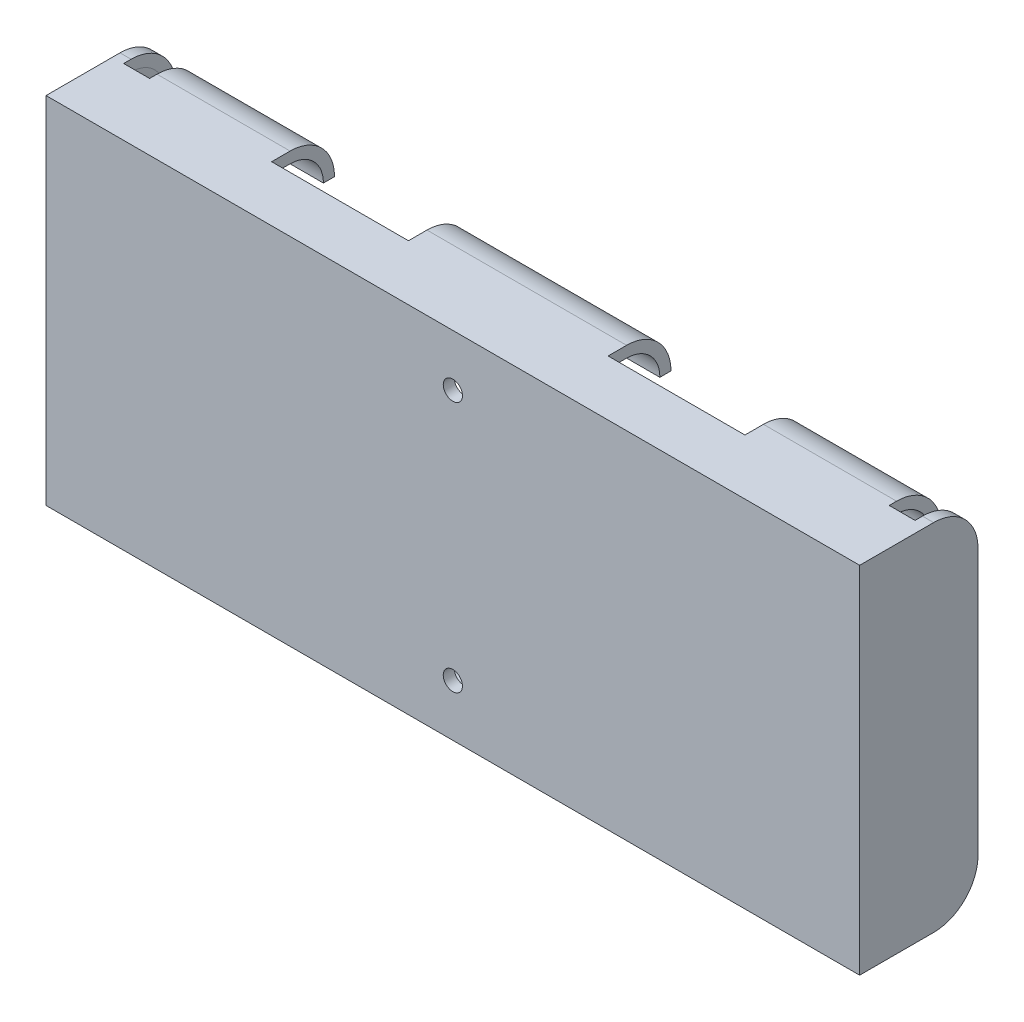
ISO-10303-21;
HEADER;
FILE_DESCRIPTION(('STEP AP214'),'2;1');
FILE_NAME('part.step','',(''),(''),'','','');
FILE_SCHEMA(('AUTOMOTIVE_DESIGN { 1 0 10303 214 1 1 1 1 }'));
ENDSEC;
DATA;
#1=APPLICATION_CONTEXT('core data for automotive mechanical design processes');
#2=APPLICATION_PROTOCOL_DEFINITION('international standard','automotive_design',2000,#1);
#3=PRODUCT_CONTEXT('',#1,'mechanical');
#4=PRODUCT('Part','Part','',(#3));
#5=PRODUCT_RELATED_PRODUCT_CATEGORY('part','',(#4));
#6=PRODUCT_DEFINITION_FORMATION('','',#4);
#7=PRODUCT_DEFINITION_CONTEXT('part definition',#1,'design');
#8=PRODUCT_DEFINITION('design','',#6,#7);
#9=PRODUCT_DEFINITION_SHAPE('','',#8);
#10=(LENGTH_UNIT() NAMED_UNIT(*) SI_UNIT(.MILLI.,.METRE.));
#11=(NAMED_UNIT(*) PLANE_ANGLE_UNIT() SI_UNIT($,.RADIAN.));
#12=(NAMED_UNIT(*) SI_UNIT($,.STERADIAN.) SOLID_ANGLE_UNIT());
#13=UNCERTAINTY_MEASURE_WITH_UNIT(LENGTH_MEASURE(1.E-05),#10,'distance_accuracy_value','');
#14=(GEOMETRIC_REPRESENTATION_CONTEXT(3) GLOBAL_UNCERTAINTY_ASSIGNED_CONTEXT((#13)) GLOBAL_UNIT_ASSIGNED_CONTEXT((#10,
#11,#12)) REPRESENTATION_CONTEXT('',''));
#15=CARTESIAN_POINT('',(0.,0.,0.));
#16=DIRECTION('',(0.,0.,1.));
#17=DIRECTION('',(1.,0.,0.));
#18=AXIS2_PLACEMENT_3D('',#15,#16,#17);
#19=CARTESIAN_POINT('',(-28.2547417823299,-7.75000000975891,-10.));
#20=DIRECTION('',(-1.,0.,0.));
#21=DIRECTION('',(0.,0.,1.));
#22=AXIS2_PLACEMENT_3D('',#19,#20,#21);
#23=CYLINDRICAL_SURFACE('',#22,6.);
#24=CARTESIAN_POINT('',(40.2405164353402,-7.75000000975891,-10.));
#25=DIRECTION('',(-1.,0.,0.));
#26=DIRECTION('',(0.,0.,1.));
#27=AXIS2_PLACEMENT_3D('',#24,#25,#26);
#28=CIRCLE('',#27,6.);
#29=CARTESIAN_POINT('',(40.2405164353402,-13.7500000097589,-10.));
#30=VERTEX_POINT('',#29);
#31=CARTESIAN_POINT('',(40.2405164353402,-7.75000000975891,-16.));
#32=VERTEX_POINT('',#31);
#33=EDGE_CURVE('E482',#30,#32,#28,.F.);
#34=ORIENTED_EDGE('',*,*,#33,.F.);
#35=DIRECTION('',(1.,0.,0.));
#36=VECTOR('',#35,1.);
#37=CARTESIAN_POINT('',(81.7452582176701,-13.7500000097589,-10.));
#38=LINE('',#37,#36);
#39=CARTESIAN_POINT('',(13.25,-13.7500000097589,-10.));
#40=VERTEX_POINT('',#39);
#41=EDGE_CURVE('E895',#40,#30,#38,.T.);
#42=ORIENTED_EDGE('',*,*,#41,.F.);
#43=CARTESIAN_POINT('',(13.25,-7.75000000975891,-10.));
#44=DIRECTION('',(1.,0.,0.));
#45=DIRECTION('',(0.,0.,-1.));
#46=AXIS2_PLACEMENT_3D('',#43,#44,#45);
#47=CIRCLE('',#46,6.);
#48=CARTESIAN_POINT('',(13.25,-7.75000000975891,-16.));
#49=VERTEX_POINT('',#48);
#50=EDGE_CURVE('E531',#49,#40,#47,.F.);
#51=ORIENTED_EDGE('',*,*,#50,.F.);
#52=DIRECTION('',(1.,0.,0.));
#53=VECTOR('',#52,1.);
#54=CARTESIAN_POINT('',(-28.2547417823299,-7.75000000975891,-16.));
#55=LINE('',#54,#53);
#56=EDGE_CURVE('E707',#32,#49,#55,.F.);
#57=ORIENTED_EDGE('',*,*,#56,.F.);
#58=EDGE_LOOP('',(#34,#42,#51,#57));
#59=FACE_BOUND('',#58,.T.);
#60=ADVANCED_FACE('F35',(#59),#23,.T.);
#61=CARTESIAN_POINT('',(-28.25,28.2499997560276,-10.));
#62=DIRECTION('',(1.,0.,0.));
#63=DIRECTION('',(0.,1.,0.));
#64=AXIS2_PLACEMENT_3D('',#61,#62,#63);
#65=CYLINDRICAL_SURFACE('',#64,6.);
#66=CARTESIAN_POINT('',(40.2405164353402,28.2499997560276,-10.));
#67=DIRECTION('',(-1.,0.,0.));
#68=DIRECTION('',(0.,0.,1.));
#69=AXIS2_PLACEMENT_3D('',#66,#67,#68);
#70=CIRCLE('',#69,6.);
#71=CARTESIAN_POINT('',(40.2405164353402,28.2499997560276,-16.));
#72=VERTEX_POINT('',#71);
#73=CARTESIAN_POINT('',(40.2405164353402,34.2499997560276,-10.));
#74=VERTEX_POINT('',#73);
#75=EDGE_CURVE('E493',#72,#74,#70,.F.);
#76=ORIENTED_EDGE('',*,*,#75,.F.);
#77=DIRECTION('',(-1.,0.,0.));
#78=VECTOR('',#77,1.);
#79=CARTESIAN_POINT('',(81.75,28.2499997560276,-16.));
#80=LINE('',#79,#78);
#81=CARTESIAN_POINT('',(13.25,28.2499997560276,-16.));
#82=VERTEX_POINT('',#81);
#83=EDGE_CURVE('E966',#82,#72,#80,.F.);
#84=ORIENTED_EDGE('',*,*,#83,.F.);
#85=CARTESIAN_POINT('',(13.25,28.2499997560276,-10.));
#86=DIRECTION('',(1.,0.,0.));
#87=DIRECTION('',(0.,0.,-1.));
#88=AXIS2_PLACEMENT_3D('',#85,#86,#87);
#89=CIRCLE('',#88,6.);
#90=CARTESIAN_POINT('',(13.25,34.2499997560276,-10.));
#91=VERTEX_POINT('',#90);
#92=EDGE_CURVE('E542',#91,#82,#89,.F.);
#93=ORIENTED_EDGE('',*,*,#92,.F.);
#94=DIRECTION('',(-1.,0.,0.));
#95=VECTOR('',#94,1.);
#96=CARTESIAN_POINT('',(-28.25,34.2499997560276,-10.));
#97=LINE('',#96,#95);
#98=EDGE_CURVE('E832',#74,#91,#97,.T.);
#99=ORIENTED_EDGE('',*,*,#98,.F.);
#100=EDGE_LOOP('',(#76,#84,#93,#99));
#101=FACE_BOUND('',#100,.T.);
#102=ADVANCED_FACE('F977',(#101),#65,.T.);
#103=CARTESIAN_POINT('',(81.75,28.2499997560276,-16.));
#104=DIRECTION('',(0.,1.,0.));
#105=DIRECTION('',(-1.,0.,0.));
#106=AXIS2_PLACEMENT_3D('',#103,#104,#105);
#107=PLANE('',#106);
#108=ORIENTED_EDGE('',*,*,#83,.T.);
#109=DIRECTION('',(0.,0.,1.));
#110=VECTOR('',#109,1.);
#111=CARTESIAN_POINT('',(40.2405164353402,28.2499997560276,-16.));
#112=LINE('',#111,#110);
#113=CARTESIAN_POINT('',(40.2405164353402,28.2499997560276,-14.5));
#114=VERTEX_POINT('',#113);
#115=EDGE_CURVE('E490',#72,#114,#112,.T.);
#116=ORIENTED_EDGE('',*,*,#115,.T.);
#117=DIRECTION('',(1.,0.,0.));
#118=VECTOR('',#117,1.);
#119=CARTESIAN_POINT('',(26.7494072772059,28.2499997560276,-14.5));
#120=LINE('',#119,#118);
#121=CARTESIAN_POINT('',(13.25,28.2499997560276,-14.5));
#122=VERTEX_POINT('',#121);
#123=EDGE_CURVE('E960',#122,#114,#120,.T.);
#124=ORIENTED_EDGE('',*,*,#123,.F.);
#125=DIRECTION('',(0.,0.,-1.));
#126=VECTOR('',#125,1.);
#127=CARTESIAN_POINT('',(13.25,28.2499997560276,-16.));
#128=LINE('',#127,#126);
#129=EDGE_CURVE('E539',#122,#82,#128,.T.);
#130=ORIENTED_EDGE('',*,*,#129,.T.);
#131=EDGE_LOOP('',(#108,#116,#124,#130));
#132=FACE_BOUND('',#131,.T.);
#133=ADVANCED_FACE('F971',(#132),#107,.F.);
#134=CARTESIAN_POINT('',(-28.2547417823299,-7.75000000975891,-16.));
#135=DIRECTION('',(0.,-1.,0.));
#136=DIRECTION('',(1.,0.,0.));
#137=AXIS2_PLACEMENT_3D('',#134,#135,#136);
#138=PLANE('',#137);
#139=DIRECTION('',(-1.,0.,0.));
#140=VECTOR('',#139,1.);
#141=CARTESIAN_POINT('',(26.7458509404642,-7.75000000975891,-14.5));
#142=LINE('',#141,#140);
#143=CARTESIAN_POINT('',(40.2405164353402,-7.75000000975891,-14.5));
#144=VERTEX_POINT('',#143);
#145=CARTESIAN_POINT('',(13.25,-7.75000000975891,-14.5));
#146=VERTEX_POINT('',#145);
#147=EDGE_CURVE('E776',#144,#146,#142,.T.);
#148=ORIENTED_EDGE('',*,*,#147,.F.);
#149=DIRECTION('',(0.,0.,-1.));
#150=VECTOR('',#149,1.);
#151=CARTESIAN_POINT('',(40.2405164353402,-7.75000000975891,-16.));
#152=LINE('',#151,#150);
#153=EDGE_CURVE('E479',#144,#32,#152,.T.);
#154=ORIENTED_EDGE('',*,*,#153,.T.);
#155=ORIENTED_EDGE('',*,*,#56,.T.);
#156=DIRECTION('',(0.,0.,1.));
#157=VECTOR('',#156,1.);
#158=CARTESIAN_POINT('',(13.25,-7.75000000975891,-16.));
#159=LINE('',#158,#157);
#160=EDGE_CURVE('E528',#49,#146,#159,.T.);
#161=ORIENTED_EDGE('',*,*,#160,.T.);
#162=EDGE_LOOP('',(#148,#154,#155,#161));
#163=FACE_BOUND('',#162,.T.);
#164=ADVANCED_FACE('F919',(#163),#138,.F.);
#165=CARTESIAN_POINT('',(-28.2547417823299,-7.75000000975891,-10.));
#166=DIRECTION('',(-1.,0.,0.));
#167=DIRECTION('',(0.,0.,1.));
#168=AXIS2_PLACEMENT_3D('',#165,#166,#167);
#169=CYLINDRICAL_SURFACE('',#168,4.5);
#170=DIRECTION('',(1.,0.,0.));
#171=VECTOR('',#170,1.);
#172=CARTESIAN_POINT('',(-28.2547417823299,-12.2500000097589,-10.));
#173=LINE('',#172,#171);
#174=CARTESIAN_POINT('',(13.25,-12.2500000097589,-10.));
#175=VERTEX_POINT('',#174);
#176=CARTESIAN_POINT('',(40.2405164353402,-12.2500000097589,-10.));
#177=VERTEX_POINT('',#176);
#178=EDGE_CURVE('E925',#175,#177,#173,.T.);
#179=ORIENTED_EDGE('',*,*,#178,.T.);
#180=CARTESIAN_POINT('',(40.2405164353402,-7.75000000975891,-10.));
#181=DIRECTION('',(-1.,0.,0.));
#182=DIRECTION('',(0.,0.,1.));
#183=AXIS2_PLACEMENT_3D('',#180,#181,#182);
#184=CIRCLE('',#183,4.5);
#185=EDGE_CURVE('E476',#177,#144,#184,.F.);
#186=ORIENTED_EDGE('',*,*,#185,.T.);
#187=ORIENTED_EDGE('',*,*,#147,.T.);
#188=CARTESIAN_POINT('',(13.25,-7.75000000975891,-10.));
#189=DIRECTION('',(1.,0.,0.));
#190=DIRECTION('',(0.,0.,-1.));
#191=AXIS2_PLACEMENT_3D('',#188,#189,#190);
#192=CIRCLE('',#191,4.5);
#193=EDGE_CURVE('E525',#146,#175,#192,.F.);
#194=ORIENTED_EDGE('',*,*,#193,.T.);
#195=EDGE_LOOP('',(#179,#186,#187,#194));
#196=FACE_BOUND('',#195,.T.);
#197=ADVANCED_FACE('F923',(#196),#169,.F.);
#198=CARTESIAN_POINT('',(-28.25,28.2499997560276,-10.));
#199=DIRECTION('',(1.,0.,0.));
#200=DIRECTION('',(0.,1.,0.));
#201=AXIS2_PLACEMENT_3D('',#198,#199,#200);
#202=CYLINDRICAL_SURFACE('',#201,4.5);
#203=ORIENTED_EDGE('',*,*,#123,.T.);
#204=CARTESIAN_POINT('',(40.2405164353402,28.2499997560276,-10.));
#205=DIRECTION('',(-1.,0.,0.));
#206=DIRECTION('',(0.,0.,1.));
#207=AXIS2_PLACEMENT_3D('',#204,#205,#206);
#208=CIRCLE('',#207,4.5);
#209=CARTESIAN_POINT('',(40.2405164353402,32.7499997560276,-10.));
#210=VERTEX_POINT('',#209);
#211=EDGE_CURVE('E487',#114,#210,#208,.F.);
#212=ORIENTED_EDGE('',*,*,#211,.T.);
#213=DIRECTION('',(-1.,0.,0.));
#214=VECTOR('',#213,1.);
#215=CARTESIAN_POINT('',(-28.25,32.7499997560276,-10.));
#216=LINE('',#215,#214);
#217=CARTESIAN_POINT('',(13.25,32.7499997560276,-10.));
#218=VERTEX_POINT('',#217);
#219=EDGE_CURVE('E730',#210,#218,#216,.T.);
#220=ORIENTED_EDGE('',*,*,#219,.T.);
#221=CARTESIAN_POINT('',(13.25,28.2499997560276,-10.));
#222=DIRECTION('',(1.,0.,0.));
#223=DIRECTION('',(0.,0.,-1.));
#224=AXIS2_PLACEMENT_3D('',#221,#222,#223);
#225=CIRCLE('',#224,4.5);
#226=EDGE_CURVE('E536',#218,#122,#225,.F.);
#227=ORIENTED_EDGE('',*,*,#226,.T.);
#228=EDGE_LOOP('',(#203,#212,#220,#227));
#229=FACE_BOUND('',#228,.T.);
#230=ADVANCED_FACE('F1081',(#229),#202,.F.);
#231=CARTESIAN_POINT('',(-5.25000000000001,-7.75000000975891,-10.));
#232=DIRECTION('',(-1.,0.,0.));
#233=DIRECTION('',(0.,0.,1.));
#234=AXIS2_PLACEMENT_3D('',#231,#232,#233);
#235=CIRCLE('',#234,6.);
#236=CARTESIAN_POINT('',(-5.25000000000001,-13.7500000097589,-10.));
#237=VERTEX_POINT('',#236);
#238=CARTESIAN_POINT('',(-5.25000000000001,-7.75000000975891,-16.));
#239=VERTEX_POINT('',#238);
#240=EDGE_CURVE('E550',#237,#239,#235,.F.);
#241=ORIENTED_EDGE('',*,*,#240,.F.);
#242=CARTESIAN_POINT('',(-23.25,-13.7500000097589,-10.));
#243=VERTEX_POINT('',#242);
#244=EDGE_CURVE('E809',#243,#237,#38,.T.);
#245=ORIENTED_EDGE('',*,*,#244,.F.);
#246=CARTESIAN_POINT('',(-23.25,-7.75000000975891,-10.));
#247=DIRECTION('',(1.,0.,0.));
#248=DIRECTION('',(0.,1.,0.));
#249=AXIS2_PLACEMENT_3D('',#246,#247,#248);
#250=CIRCLE('',#249,6.);
#251=CARTESIAN_POINT('',(-23.25,-7.75000000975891,-16.));
#252=VERTEX_POINT('',#251);
#253=EDGE_CURVE('E690',#252,#243,#250,.F.);
#254=ORIENTED_EDGE('',*,*,#253,.F.);
#255=EDGE_CURVE('E885',#239,#252,#55,.F.);
#256=ORIENTED_EDGE('',*,*,#255,.F.);
#257=EDGE_LOOP('',(#241,#245,#254,#256));
#258=FACE_BOUND('',#257,.T.);
#259=ADVANCED_FACE('F901',(#258),#23,.T.);
#260=CARTESIAN_POINT('',(-5.25,28.2499997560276,-10.));
#261=DIRECTION('',(-1.,0.,0.));
#262=DIRECTION('',(0.,0.,1.));
#263=AXIS2_PLACEMENT_3D('',#260,#261,#262);
#264=CIRCLE('',#263,6.);
#265=CARTESIAN_POINT('',(-5.25,28.2499997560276,-16.));
#266=VERTEX_POINT('',#265);
#267=CARTESIAN_POINT('',(-5.25,34.2499997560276,-10.));
#268=VERTEX_POINT('',#267);
#269=EDGE_CURVE('E561',#266,#268,#264,.F.);
#270=ORIENTED_EDGE('',*,*,#269,.F.);
#271=CARTESIAN_POINT('',(-23.25,28.2499997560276,-16.));
#272=VERTEX_POINT('',#271);
#273=EDGE_CURVE('E700',#272,#266,#80,.F.);
#274=ORIENTED_EDGE('',*,*,#273,.F.);
#275=CARTESIAN_POINT('',(-23.25,28.2499997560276,-10.));
#276=DIRECTION('',(1.,0.,0.));
#277=DIRECTION('',(0.,1.,0.));
#278=AXIS2_PLACEMENT_3D('',#275,#276,#277);
#279=CIRCLE('',#278,6.);
#280=CARTESIAN_POINT('',(-23.25,34.2499997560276,-10.));
#281=VERTEX_POINT('',#280);
#282=EDGE_CURVE('E679',#281,#272,#279,.F.);
#283=ORIENTED_EDGE('',*,*,#282,.F.);
#284=EDGE_CURVE('E1038',#268,#281,#97,.T.);
#285=ORIENTED_EDGE('',*,*,#284,.F.);
#286=EDGE_LOOP('',(#270,#274,#283,#285));
#287=FACE_BOUND('',#286,.T.);
#288=ADVANCED_FACE('F1066',(#287),#65,.T.);
#289=ORIENTED_EDGE('',*,*,#273,.T.);
#290=DIRECTION('',(0.,0.,1.));
#291=VECTOR('',#290,1.);
#292=CARTESIAN_POINT('',(-5.25,28.2499997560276,-16.));
#293=LINE('',#292,#291);
#294=CARTESIAN_POINT('',(-5.25000000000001,28.2499997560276,-14.5));
#295=VERTEX_POINT('',#294);
#296=EDGE_CURVE('E558',#266,#295,#293,.T.);
#297=ORIENTED_EDGE('',*,*,#296,.T.);
#298=CARTESIAN_POINT('',(-23.25,28.2499997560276,-14.5));
#299=VERTEX_POINT('',#298);
#300=EDGE_CURVE('E762',#299,#295,#120,.T.);
#301=ORIENTED_EDGE('',*,*,#300,.F.);
#302=DIRECTION('',(0.,0.,-1.));
#303=VECTOR('',#302,1.);
#304=CARTESIAN_POINT('',(-23.25,28.2499997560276,-16.));
#305=LINE('',#304,#303);
#306=EDGE_CURVE('E676',#299,#272,#305,.T.);
#307=ORIENTED_EDGE('',*,*,#306,.T.);
#308=EDGE_LOOP('',(#289,#297,#301,#307));
#309=FACE_BOUND('',#308,.T.);
#310=ADVANCED_FACE('F1058',(#309),#107,.F.);
#311=CARTESIAN_POINT('',(-5.25000000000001,-7.75000000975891,-14.5));
#312=VERTEX_POINT('',#311);
#313=CARTESIAN_POINT('',(-23.25,-7.75000000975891,-14.5));
#314=VERTEX_POINT('',#313);
#315=EDGE_CURVE('E871',#312,#314,#142,.T.);
#316=ORIENTED_EDGE('',*,*,#315,.F.);
#317=DIRECTION('',(0.,0.,-1.));
#318=VECTOR('',#317,1.);
#319=CARTESIAN_POINT('',(-5.25000000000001,-7.75000000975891,-16.));
#320=LINE('',#319,#318);
#321=EDGE_CURVE('E547',#312,#239,#320,.T.);
#322=ORIENTED_EDGE('',*,*,#321,.T.);
#323=ORIENTED_EDGE('',*,*,#255,.T.);
#324=DIRECTION('',(0.,0.,1.));
#325=VECTOR('',#324,1.);
#326=CARTESIAN_POINT('',(-23.25,-7.75000000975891,-16.));
#327=LINE('',#326,#325);
#328=EDGE_CURVE('E687',#252,#314,#327,.T.);
#329=ORIENTED_EDGE('',*,*,#328,.T.);
#330=EDGE_LOOP('',(#316,#322,#323,#329));
#331=FACE_BOUND('',#330,.T.);
#332=ADVANCED_FACE('F883',(#331),#138,.F.);
#333=CARTESIAN_POINT('',(-23.25,-12.2500000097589,-10.));
#334=VERTEX_POINT('',#333);
#335=CARTESIAN_POINT('',(-5.25000000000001,-12.2500000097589,-10.));
#336=VERTEX_POINT('',#335);
#337=EDGE_CURVE('E748',#334,#336,#173,.T.);
#338=ORIENTED_EDGE('',*,*,#337,.T.);
#339=CARTESIAN_POINT('',(-5.25000000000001,-7.75000000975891,-10.));
#340=DIRECTION('',(-1.,0.,0.));
#341=DIRECTION('',(0.,0.,1.));
#342=AXIS2_PLACEMENT_3D('',#339,#340,#341);
#343=CIRCLE('',#342,4.5);
#344=EDGE_CURVE('E544',#336,#312,#343,.F.);
#345=ORIENTED_EDGE('',*,*,#344,.T.);
#346=ORIENTED_EDGE('',*,*,#315,.T.);
#347=CARTESIAN_POINT('',(-23.25,-7.75000000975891,-10.));
#348=DIRECTION('',(1.,0.,0.));
#349=DIRECTION('',(0.,1.,0.));
#350=AXIS2_PLACEMENT_3D('',#347,#348,#349);
#351=CIRCLE('',#350,4.5);
#352=EDGE_CURVE('E681',#314,#334,#351,.F.);
#353=ORIENTED_EDGE('',*,*,#352,.T.);
#354=EDGE_LOOP('',(#338,#345,#346,#353));
#355=FACE_BOUND('',#354,.T.);
#356=ADVANCED_FACE('F876',(#355),#169,.F.);
#357=ORIENTED_EDGE('',*,*,#300,.T.);
#358=CARTESIAN_POINT('',(-5.25,28.2499997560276,-10.));
#359=DIRECTION('',(-1.,0.,0.));
#360=DIRECTION('',(0.,0.,1.));
#361=AXIS2_PLACEMENT_3D('',#358,#359,#360);
#362=CIRCLE('',#361,4.5);
#363=CARTESIAN_POINT('',(-5.25,32.7499997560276,-10.));
#364=VERTEX_POINT('',#363);
#365=EDGE_CURVE('E555',#295,#364,#362,.F.);
#366=ORIENTED_EDGE('',*,*,#365,.T.);
#367=CARTESIAN_POINT('',(-23.25,32.7499997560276,-10.));
#368=VERTEX_POINT('',#367);
#369=EDGE_CURVE('E995',#364,#368,#216,.T.);
#370=ORIENTED_EDGE('',*,*,#369,.T.);
#371=CARTESIAN_POINT('',(-23.25,28.2499997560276,-10.));
#372=DIRECTION('',(1.,0.,0.));
#373=DIRECTION('',(0.,1.,0.));
#374=AXIS2_PLACEMENT_3D('',#371,#372,#373);
#375=CIRCLE('',#374,4.5);
#376=EDGE_CURVE('E835',#368,#299,#375,.F.);
#377=ORIENTED_EDGE('',*,*,#376,.T.);
#378=EDGE_LOOP('',(#357,#366,#370,#377));
#379=FACE_BOUND('',#378,.T.);
#380=ADVANCED_FACE('F1056',(#379),#202,.F.);
#381=CARTESIAN_POINT('',(58.7405164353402,-7.75000000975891,-10.));
#382=DIRECTION('',(1.,0.,0.));
#383=DIRECTION('',(0.,1.,0.));
#384=AXIS2_PLACEMENT_3D('',#381,#382,#383);
#385=CIRCLE('',#384,6.);
#386=CARTESIAN_POINT('',(58.7405164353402,-7.75000000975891,-16.));
#387=VERTEX_POINT('',#386);
#388=CARTESIAN_POINT('',(58.7405164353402,-13.7500000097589,-10.));
#389=VERTEX_POINT('',#388);
#390=EDGE_CURVE('E437',#387,#389,#385,.F.);
#391=ORIENTED_EDGE('',*,*,#390,.F.);
#392=CARTESIAN_POINT('',(76.7405164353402,-7.75000000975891,-16.));
#393=VERTEX_POINT('',#392);
#394=EDGE_CURVE('E706',#393,#387,#55,.F.);
#395=ORIENTED_EDGE('',*,*,#394,.F.);
#396=CARTESIAN_POINT('',(76.7405164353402,-7.75000000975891,-10.));
#397=DIRECTION('',(-1.,0.,0.));
#398=DIRECTION('',(0.,-1.,0.));
#399=AXIS2_PLACEMENT_3D('',#396,#397,#398);
#400=CIRCLE('',#399,6.);
#401=CARTESIAN_POINT('',(76.7405164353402,-13.7500000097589,-10.));
#402=VERTEX_POINT('',#401);
#403=EDGE_CURVE('E612',#402,#393,#400,.F.);
#404=ORIENTED_EDGE('',*,*,#403,.F.);
#405=EDGE_CURVE('E810',#389,#402,#38,.T.);
#406=ORIENTED_EDGE('',*,*,#405,.F.);
#407=EDGE_LOOP('',(#391,#395,#404,#406));
#408=FACE_BOUND('',#407,.T.);
#409=ADVANCED_FACE('F893',(#408),#23,.T.);
#410=CARTESIAN_POINT('',(58.7405164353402,28.2499997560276,-10.));
#411=DIRECTION('',(1.,0.,0.));
#412=DIRECTION('',(0.,1.,0.));
#413=AXIS2_PLACEMENT_3D('',#410,#411,#412);
#414=CIRCLE('',#413,6.);
#415=CARTESIAN_POINT('',(58.7405164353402,34.2499997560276,-10.));
#416=VERTEX_POINT('',#415);
#417=CARTESIAN_POINT('',(58.7405164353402,28.2499997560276,-16.));
#418=VERTEX_POINT('',#417);
#419=EDGE_CURVE('E474',#416,#418,#414,.F.);
#420=ORIENTED_EDGE('',*,*,#419,.F.);
#421=CARTESIAN_POINT('',(76.7405164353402,34.2499997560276,-10.));
#422=VERTEX_POINT('',#421);
#423=EDGE_CURVE('E831',#422,#416,#97,.T.);
#424=ORIENTED_EDGE('',*,*,#423,.F.);
#425=CARTESIAN_POINT('',(76.7405164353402,28.2499997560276,-10.));
#426=DIRECTION('',(-1.,0.,0.));
#427=DIRECTION('',(0.,-1.,0.));
#428=AXIS2_PLACEMENT_3D('',#425,#426,#427);
#429=CIRCLE('',#428,6.);
#430=CARTESIAN_POINT('',(76.7405164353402,28.2499997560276,-16.));
#431=VERTEX_POINT('',#430);
#432=EDGE_CURVE('E623',#431,#422,#429,.F.);
#433=ORIENTED_EDGE('',*,*,#432,.F.);
#434=EDGE_CURVE('E701',#418,#431,#80,.F.);
#435=ORIENTED_EDGE('',*,*,#434,.F.);
#436=EDGE_LOOP('',(#420,#424,#433,#435));
#437=FACE_BOUND('',#436,.T.);
#438=ADVANCED_FACE('F1045',(#437),#65,.T.);
#439=CARTESIAN_POINT('',(58.7405164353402,28.2499997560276,-14.5));
#440=VERTEX_POINT('',#439);
#441=CARTESIAN_POINT('',(76.7405164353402,28.2499997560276,-14.5));
#442=VERTEX_POINT('',#441);
#443=EDGE_CURVE('E763',#440,#442,#120,.T.);
#444=ORIENTED_EDGE('',*,*,#443,.F.);
#445=DIRECTION('',(0.,0.,-1.));
#446=VECTOR('',#445,1.);
#447=CARTESIAN_POINT('',(58.7405164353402,28.2499997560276,-16.));
#448=LINE('',#447,#446);
#449=EDGE_CURVE('E471',#440,#418,#448,.T.);
#450=ORIENTED_EDGE('',*,*,#449,.T.);
#451=ORIENTED_EDGE('',*,*,#434,.T.);
#452=DIRECTION('',(0.,0.,1.));
#453=VECTOR('',#452,1.);
#454=CARTESIAN_POINT('',(76.7405164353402,28.2499997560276,-16.));
#455=LINE('',#454,#453);
#456=EDGE_CURVE('E620',#431,#442,#455,.T.);
#457=ORIENTED_EDGE('',*,*,#456,.T.);
#458=EDGE_LOOP('',(#444,#450,#451,#457));
#459=FACE_BOUND('',#458,.T.);
#460=ADVANCED_FACE('F1050',(#459),#107,.F.);
#461=ORIENTED_EDGE('',*,*,#394,.T.);
#462=DIRECTION('',(0.,0.,1.));
#463=VECTOR('',#462,1.);
#464=CARTESIAN_POINT('',(58.7405164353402,-7.75000000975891,-16.));
#465=LINE('',#464,#463);
#466=CARTESIAN_POINT('',(58.7405164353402,-7.75000000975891,-14.5));
#467=VERTEX_POINT('',#466);
#468=EDGE_CURVE('E464',#387,#467,#465,.T.);
#469=ORIENTED_EDGE('',*,*,#468,.T.);
#470=CARTESIAN_POINT('',(76.7405164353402,-7.75000000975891,-14.5));
#471=VERTEX_POINT('',#470);
#472=EDGE_CURVE('E775',#471,#467,#142,.T.);
#473=ORIENTED_EDGE('',*,*,#472,.F.);
#474=DIRECTION('',(0.,0.,-1.));
#475=VECTOR('',#474,1.);
#476=CARTESIAN_POINT('',(76.7405164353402,-7.75000000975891,-16.));
#477=LINE('',#476,#475);
#478=EDGE_CURVE('E609',#471,#393,#477,.T.);
#479=ORIENTED_EDGE('',*,*,#478,.T.);
#480=EDGE_LOOP('',(#461,#469,#473,#479));
#481=FACE_BOUND('',#480,.T.);
#482=ADVANCED_FACE('F890',(#481),#138,.F.);
#483=ORIENTED_EDGE('',*,*,#472,.T.);
#484=CARTESIAN_POINT('',(58.7405164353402,-7.75000000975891,-10.));
#485=DIRECTION('',(1.,0.,0.));
#486=DIRECTION('',(0.,1.,0.));
#487=AXIS2_PLACEMENT_3D('',#484,#485,#486);
#488=CIRCLE('',#487,4.5);
#489=CARTESIAN_POINT('',(58.7405164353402,-12.2500000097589,-10.));
#490=VERTEX_POINT('',#489);
#491=EDGE_CURVE('E460',#467,#490,#488,.F.);
#492=ORIENTED_EDGE('',*,*,#491,.T.);
#493=CARTESIAN_POINT('',(76.7405164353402,-12.2500000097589,-10.));
#494=VERTEX_POINT('',#493);
#495=EDGE_CURVE('E749',#490,#494,#173,.T.);
#496=ORIENTED_EDGE('',*,*,#495,.T.);
#497=CARTESIAN_POINT('',(76.7405164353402,-7.75000000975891,-10.));
#498=DIRECTION('',(-1.,0.,0.));
#499=DIRECTION('',(0.,-1.,0.));
#500=AXIS2_PLACEMENT_3D('',#497,#498,#499);
#501=CIRCLE('',#500,4.5);
#502=EDGE_CURVE('E606',#494,#471,#501,.F.);
#503=ORIENTED_EDGE('',*,*,#502,.T.);
#504=EDGE_LOOP('',(#483,#492,#496,#503));
#505=FACE_BOUND('',#504,.T.);
#506=ADVANCED_FACE('F867',(#505),#169,.F.);
#507=CARTESIAN_POINT('',(76.7405164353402,32.7499997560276,-10.));
#508=VERTEX_POINT('',#507);
#509=CARTESIAN_POINT('',(58.7405164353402,32.7499997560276,-10.));
#510=VERTEX_POINT('',#509);
#511=EDGE_CURVE('E729',#508,#510,#216,.T.);
#512=ORIENTED_EDGE('',*,*,#511,.T.);
#513=CARTESIAN_POINT('',(58.7405164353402,28.2499997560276,-10.));
#514=DIRECTION('',(1.,0.,0.));
#515=DIRECTION('',(0.,1.,0.));
#516=AXIS2_PLACEMENT_3D('',#513,#514,#515);
#517=CIRCLE('',#516,4.5);
#518=EDGE_CURVE('E50',#510,#440,#517,.F.);
#519=ORIENTED_EDGE('',*,*,#518,.T.);
#520=ORIENTED_EDGE('',*,*,#443,.T.);
#521=CARTESIAN_POINT('',(76.7405164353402,28.2499997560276,-10.));
#522=DIRECTION('',(-1.,0.,0.));
#523=DIRECTION('',(0.,-1.,0.));
#524=AXIS2_PLACEMENT_3D('',#521,#522,#523);
#525=CIRCLE('',#524,4.5);
#526=EDGE_CURVE('E617',#442,#508,#525,.F.);
#527=ORIENTED_EDGE('',*,*,#526,.T.);
#528=EDGE_LOOP('',(#512,#519,#520,#527));
#529=FACE_BOUND('',#528,.T.);
#530=ADVANCED_FACE('F1092',(#529),#202,.F.);
#531=CARTESIAN_POINT('',(80.2405164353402,-7.75000000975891,-10.));
#532=DIRECTION('',(1.,0.,0.));
#533=DIRECTION('',(0.,1.,0.));
#534=AXIS2_PLACEMENT_3D('',#531,#532,#533);
#535=CIRCLE('',#534,6.);
#536=CARTESIAN_POINT('',(80.2405164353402,-7.75000000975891,-16.));
#537=VERTEX_POINT('',#536);
#538=CARTESIAN_POINT('',(80.2405164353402,-13.7500000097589,-10.));
#539=VERTEX_POINT('',#538);
#540=EDGE_CURVE('E593',#537,#539,#535,.F.);
#541=ORIENTED_EDGE('',*,*,#540,.F.);
#542=CARTESIAN_POINT('',(80.2458509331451,-7.75000000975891,-16.));
#543=VERTEX_POINT('',#542);
#544=EDGE_CURVE('E702',#543,#537,#55,.F.);
#545=ORIENTED_EDGE('',*,*,#544,.F.);
#546=DIRECTION('',(1.,0.,0.));
#547=VECTOR('',#546,1.);
#548=CARTESIAN_POINT('',(-28.2547417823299,-7.75000000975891,-16.));
#549=LINE('',#548,#547);
#550=CARTESIAN_POINT('',(81.7458509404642,-7.75000000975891,-16.));
#551=VERTEX_POINT('',#550);
#552=EDGE_CURVE('E819',#551,#543,#549,.F.);
#553=ORIENTED_EDGE('',*,*,#552,.F.);
#554=CARTESIAN_POINT('',(81.7458509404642,-7.75000000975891,-10.));
#555=DIRECTION('',(0.999999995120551,-9.87871318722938E-05,0.));
#556=DIRECTION('',(-9.87871318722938E-05,-0.999999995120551,0.));
#557=AXIS2_PLACEMENT_3D('',#554,#555,#556);
#558=ELLIPSE('',#557,6.00000002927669,6.);
#559=CARTESIAN_POINT('',(81.7452582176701,-13.7500000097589,-10.));
#560=VERTEX_POINT('',#559);
#561=EDGE_CURVE('E812',#560,#551,#558,.T.);
#562=ORIENTED_EDGE('',*,*,#561,.F.);
#563=EDGE_CURVE('E799',#539,#560,#38,.T.);
#564=ORIENTED_EDGE('',*,*,#563,.F.);
#565=EDGE_LOOP('',(#541,#545,#553,#562,#564));
#566=FACE_BOUND('',#565,.T.);
#567=ADVANCED_FACE('F1100',(#566),#23,.T.);
#568=CARTESIAN_POINT('',(80.2405164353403,28.2499997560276,-10.));
#569=DIRECTION('',(1.,0.,0.));
#570=DIRECTION('',(0.,1.,0.));
#571=AXIS2_PLACEMENT_3D('',#568,#569,#570);
#572=CIRCLE('',#571,6.);
#573=CARTESIAN_POINT('',(80.2405164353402,34.2499997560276,-10.));
#574=VERTEX_POINT('',#573);
#575=CARTESIAN_POINT('',(80.2405164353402,28.2499997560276,-16.));
#576=VERTEX_POINT('',#575);
#577=EDGE_CURVE('E604',#574,#576,#572,.F.);
#578=ORIENTED_EDGE('',*,*,#577,.F.);
#579=CARTESIAN_POINT('',(81.75,34.2499997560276,-10.));
#580=VERTEX_POINT('',#579);
#581=EDGE_CURVE('E827',#580,#574,#97,.T.);
#582=ORIENTED_EDGE('',*,*,#581,.F.);
#583=CARTESIAN_POINT('',(81.7494072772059,28.2499997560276,-10.));
#584=DIRECTION('',(0.999999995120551,-9.87871318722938E-05,0.));
#585=DIRECTION('',(9.87871318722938E-05,0.999999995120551,0.));
#586=AXIS2_PLACEMENT_3D('',#583,#584,#585);
#587=ELLIPSE('',#586,6.00000002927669,6.);
#588=CARTESIAN_POINT('',(81.7494072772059,28.2499997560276,-16.));
#589=VERTEX_POINT('',#588);
#590=EDGE_CURVE('E808',#589,#580,#587,.T.);
#591=ORIENTED_EDGE('',*,*,#590,.F.);
#592=DIRECTION('',(-1.,0.,0.));
#593=VECTOR('',#592,1.);
#594=CARTESIAN_POINT('',(81.75,28.2499997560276,-16.));
#595=LINE('',#594,#593);
#596=CARTESIAN_POINT('',(80.2494072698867,28.2499997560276,-16.));
#597=VERTEX_POINT('',#596);
#598=EDGE_CURVE('E814',#597,#589,#595,.F.);
#599=ORIENTED_EDGE('',*,*,#598,.F.);
#600=EDGE_CURVE('E740',#576,#597,#80,.F.);
#601=ORIENTED_EDGE('',*,*,#600,.F.);
#602=EDGE_LOOP('',(#578,#582,#591,#599,#601));
#603=FACE_BOUND('',#602,.T.);
#604=ADVANCED_FACE('F1105',(#603),#65,.T.);
#605=CARTESIAN_POINT('',(80.2405164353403,28.2499997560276,-14.5));
#606=VERTEX_POINT('',#605);
#607=CARTESIAN_POINT('',(80.2494072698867,28.2499997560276,-14.5));
#608=VERTEX_POINT('',#607);
#609=EDGE_CURVE('E774',#606,#608,#120,.T.);
#610=ORIENTED_EDGE('',*,*,#609,.F.);
#611=DIRECTION('',(0.,0.,-1.));
#612=VECTOR('',#611,1.);
#613=CARTESIAN_POINT('',(80.2405164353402,28.2499997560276,-16.));
#614=LINE('',#613,#612);
#615=EDGE_CURVE('E601',#606,#576,#614,.T.);
#616=ORIENTED_EDGE('',*,*,#615,.T.);
#617=ORIENTED_EDGE('',*,*,#600,.T.);
#618=DIRECTION('',(0.,0.,-1.));
#619=VECTOR('',#618,1.);
#620=CARTESIAN_POINT('',(80.2494072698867,28.2499997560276,-16.));
#621=LINE('',#620,#619);
#622=EDGE_CURVE('E757',#608,#597,#621,.T.);
#623=ORIENTED_EDGE('',*,*,#622,.F.);
#624=EDGE_LOOP('',(#610,#616,#617,#623));
#625=FACE_BOUND('',#624,.T.);
#626=ADVANCED_FACE('F961',(#625),#107,.F.);
#627=ORIENTED_EDGE('',*,*,#544,.T.);
#628=DIRECTION('',(0.,0.,1.));
#629=VECTOR('',#628,1.);
#630=CARTESIAN_POINT('',(80.2405164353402,-7.75000000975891,-16.));
#631=LINE('',#630,#629);
#632=CARTESIAN_POINT('',(80.2405164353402,-7.75000000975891,-14.5));
#633=VERTEX_POINT('',#632);
#634=EDGE_CURVE('E590',#537,#633,#631,.T.);
#635=ORIENTED_EDGE('',*,*,#634,.T.);
#636=CARTESIAN_POINT('',(80.2458509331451,-7.75000000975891,-14.5));
#637=VERTEX_POINT('',#636);
#638=EDGE_CURVE('E771',#637,#633,#142,.T.);
#639=ORIENTED_EDGE('',*,*,#638,.F.);
#640=DIRECTION('',(0.,0.,-1.));
#641=VECTOR('',#640,1.);
#642=CARTESIAN_POINT('',(80.2458509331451,-7.75000000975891,-16.));
#643=LINE('',#642,#641);
#644=EDGE_CURVE('E766',#637,#543,#643,.T.);
#645=ORIENTED_EDGE('',*,*,#644,.T.);
#646=EDGE_LOOP('',(#627,#635,#639,#645));
#647=FACE_BOUND('',#646,.T.);
#648=ADVANCED_FACE('F1142',(#647),#138,.F.);
#649=ORIENTED_EDGE('',*,*,#638,.T.);
#650=CARTESIAN_POINT('',(80.2405164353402,-7.75000000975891,-10.));
#651=DIRECTION('',(1.,0.,0.));
#652=DIRECTION('',(0.,1.,0.));
#653=AXIS2_PLACEMENT_3D('',#650,#651,#652);
#654=CIRCLE('',#653,4.5);
#655=CARTESIAN_POINT('',(80.2405164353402,-12.2500000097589,-10.));
#656=VERTEX_POINT('',#655);
#657=EDGE_CURVE('E584',#633,#656,#654,.F.);
#658=ORIENTED_EDGE('',*,*,#657,.T.);
#659=CARTESIAN_POINT('',(80.2454063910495,-12.2500000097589,-10.));
#660=VERTEX_POINT('',#659);
#661=EDGE_CURVE('E720',#656,#660,#173,.T.);
#662=ORIENTED_EDGE('',*,*,#661,.T.);
#663=CARTESIAN_POINT('',(80.2458509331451,-7.75000000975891,-10.));
#664=DIRECTION('',(0.999999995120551,-9.87871318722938E-05,0.));
#665=DIRECTION('',(-9.87871318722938E-05,-0.999999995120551,0.));
#666=AXIS2_PLACEMENT_3D('',#663,#664,#665);
#667=ELLIPSE('',#666,4.50000002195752,4.5);
#668=EDGE_CURVE('E737',#660,#637,#667,.T.);
#669=ORIENTED_EDGE('',*,*,#668,.T.);
#670=EDGE_LOOP('',(#649,#658,#662,#669));
#671=FACE_BOUND('',#670,.T.);
#672=ADVANCED_FACE('F929',(#671),#169,.F.);
#673=CARTESIAN_POINT('',(80.2498518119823,32.7499997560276,-10.));
#674=VERTEX_POINT('',#673);
#675=CARTESIAN_POINT('',(80.2405164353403,32.7499997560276,-10.));
#676=VERTEX_POINT('',#675);
#677=EDGE_CURVE('E725',#674,#676,#216,.T.);
#678=ORIENTED_EDGE('',*,*,#677,.T.);
#679=CARTESIAN_POINT('',(80.2405164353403,28.2499997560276,-10.));
#680=DIRECTION('',(1.,0.,0.));
#681=DIRECTION('',(0.,1.,0.));
#682=AXIS2_PLACEMENT_3D('',#679,#680,#681);
#683=CIRCLE('',#682,4.5);
#684=EDGE_CURVE('E598',#676,#606,#683,.F.);
#685=ORIENTED_EDGE('',*,*,#684,.T.);
#686=ORIENTED_EDGE('',*,*,#609,.T.);
#687=CARTESIAN_POINT('',(80.2494072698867,28.2499997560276,-10.));
#688=DIRECTION('',(0.999999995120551,-9.87871318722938E-05,0.));
#689=DIRECTION('',(9.87871318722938E-05,0.999999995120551,0.));
#690=AXIS2_PLACEMENT_3D('',#687,#688,#689);
#691=ELLIPSE('',#690,4.50000002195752,4.5);
#692=EDGE_CURVE('E741',#608,#674,#691,.T.);
#693=ORIENTED_EDGE('',*,*,#692,.T.);
#694=EDGE_LOOP('',(#678,#685,#686,#693));
#695=FACE_BOUND('',#694,.T.);
#696=ADVANCED_FACE('F957',(#695),#202,.F.);
#697=CARTESIAN_POINT('',(-28.25,34.2499997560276,-16.));
#698=DIRECTION('',(0.,0.,1.));
#699=DIRECTION('',(1.,0.,0.));
#700=AXIS2_PLACEMENT_3D('',#697,#698,#699);
#701=PLANE('',#700);
#702=ORIENTED_EDGE('',*,*,#552,.T.);
#703=DIRECTION('',(9.87871318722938E-05,0.999999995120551,0.));
#704=VECTOR('',#703,1.);
#705=CARTESIAN_POINT('',(80.2499989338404,34.2392813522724,-16.));
#706=LINE('',#705,#704);
#707=EDGE_CURVE('E714',#543,#597,#706,.T.);
#708=ORIENTED_EDGE('',*,*,#707,.T.);
#709=ORIENTED_EDGE('',*,*,#598,.T.);
#710=DIRECTION('',(9.87871318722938E-05,0.999999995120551,0.));
#711=VECTOR('',#710,1.);
#712=CARTESIAN_POINT('',(81.75,34.2499997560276,-16.));
#713=LINE('',#712,#711);
#714=EDGE_CURVE('E782',#551,#589,#713,.T.);
#715=ORIENTED_EDGE('',*,*,#714,.F.);
#716=EDGE_LOOP('',(#702,#708,#709,#715));
#717=FACE_BOUND('',#716,.T.);
#718=ADVANCED_FACE('F1229',(#717),#701,.F.);
#719=CARTESIAN_POINT('',(-28.25,34.2499997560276,-16.));
#720=DIRECTION('',(-0.999999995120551,9.87871318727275E-05,0.));
#721=DIRECTION('',(-9.87871318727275E-05,-0.999999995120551,0.));
#722=AXIS2_PLACEMENT_3D('',#719,#720,#721);
#723=PLANE('',#722);
#724=DIRECTION('',(-9.87871318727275E-05,-0.999999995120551,0.));
#725=VECTOR('',#724,1.);
#726=CARTESIAN_POINT('',(-28.25,34.2499997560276,-16.));
#727=LINE('',#726,#725);
#728=CARTESIAN_POINT('',(-28.2505927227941,28.2499997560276,-16.));
#729=VERTEX_POINT('',#728);
#730=CARTESIAN_POINT('',(-28.2541490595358,-7.75000000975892,-16.));
#731=VERTEX_POINT('',#730);
#732=EDGE_CURVE('E779',#729,#731,#727,.T.);
#733=ORIENTED_EDGE('',*,*,#732,.T.);
#734=CARTESIAN_POINT('',(-28.2541490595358,-7.75000000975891,-10.));
#735=DIRECTION('',(-0.999999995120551,9.87871318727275E-05,0.));
#736=DIRECTION('',(-9.87871318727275E-05,-0.999999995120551,0.));
#737=AXIS2_PLACEMENT_3D('',#734,#735,#736);
#738=ELLIPSE('',#737,6.00000002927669,6.);
#739=CARTESIAN_POINT('',(-28.2547417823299,-13.7500000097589,-10.));
#740=VERTEX_POINT('',#739);
#741=EDGE_CURVE('E824',#731,#740,#738,.T.);
#742=ORIENTED_EDGE('',*,*,#741,.T.);
#743=DIRECTION('',(0.,0.,1.));
#744=VECTOR('',#743,1.);
#745=CARTESIAN_POINT('',(-28.2547417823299,-13.7500000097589,-16.));
#746=LINE('',#745,#744);
#747=CARTESIAN_POINT('',(-28.2547417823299,-13.7500000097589,0.));
#748=VERTEX_POINT('',#747);
#749=EDGE_CURVE('E786',#740,#748,#746,.T.);
#750=ORIENTED_EDGE('',*,*,#749,.T.);
#751=DIRECTION('',(-9.87871318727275E-05,-0.999999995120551,0.));
#752=VECTOR('',#751,1.);
#753=CARTESIAN_POINT('',(-28.25,34.2499997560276,0.));
#754=LINE('',#753,#752);
#755=CARTESIAN_POINT('',(-28.25,34.2499997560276,0.));
#756=VERTEX_POINT('',#755);
#757=EDGE_CURVE('E756',#756,#748,#754,.T.);
#758=ORIENTED_EDGE('',*,*,#757,.F.);
#759=DIRECTION('',(0.,0.,1.));
#760=VECTOR('',#759,1.);
#761=CARTESIAN_POINT('',(-28.25,34.2499997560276,-16.));
#762=LINE('',#761,#760);
#763=CARTESIAN_POINT('',(-28.25,34.2499997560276,-10.));
#764=VERTEX_POINT('',#763);
#765=EDGE_CURVE('E797',#764,#756,#762,.T.);
#766=ORIENTED_EDGE('',*,*,#765,.F.);
#767=CARTESIAN_POINT('',(-28.2505927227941,28.2499997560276,-10.));
#768=DIRECTION('',(-0.999999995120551,9.87871318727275E-05,0.));
#769=DIRECTION('',(9.87871318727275E-05,0.999999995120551,0.));
#770=AXIS2_PLACEMENT_3D('',#767,#768,#769);
#771=ELLIPSE('',#770,6.00000002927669,6.);
#772=EDGE_CURVE('E822',#764,#729,#771,.T.);
#773=ORIENTED_EDGE('',*,*,#772,.T.);
#774=EDGE_LOOP('',(#733,#742,#750,#758,#766,#773));
#775=FACE_BOUND('',#774,.T.);
#776=ADVANCED_FACE('F1020',(#775),#723,.T.);
#777=CARTESIAN_POINT('',(-28.25,34.2499997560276,-16.));
#778=DIRECTION('',(0.,1.,0.));
#779=DIRECTION('',(-1.,0.,0.));
#780=AXIS2_PLACEMENT_3D('',#777,#778,#779);
#781=PLANE('',#780);
#782=DIRECTION('',(0.,0.,1.));
#783=VECTOR('',#782,1.);
#784=CARTESIAN_POINT('',(40.2405164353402,34.2499997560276,-7.50000000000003));
#785=LINE('',#784,#783);
#786=CARTESIAN_POINT('',(40.2405164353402,34.2499997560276,-7.50000000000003));
#787=VERTEX_POINT('',#786);
#788=EDGE_CURVE('E444',#74,#787,#785,.T.);
#789=ORIENTED_EDGE('',*,*,#788,.F.);
#790=ORIENTED_EDGE('',*,*,#98,.T.);
#791=DIRECTION('',(0.,0.,-1.));
#792=VECTOR('',#791,1.);
#793=CARTESIAN_POINT('',(13.25,34.2499997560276,-7.50000000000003));
#794=LINE('',#793,#792);
#795=CARTESIAN_POINT('',(13.25,34.2499997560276,-7.50000000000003));
#796=VERTEX_POINT('',#795);
#797=EDGE_CURVE('E503',#796,#91,#794,.T.);
#798=ORIENTED_EDGE('',*,*,#797,.F.);
#799=DIRECTION('',(1.,0.,0.));
#800=VECTOR('',#799,1.);
#801=CARTESIAN_POINT('',(-5.25,34.2499997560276,-7.50000000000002));
#802=LINE('',#801,#800);
#803=CARTESIAN_POINT('',(-5.25,34.2499997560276,-7.50000000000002));
#804=VERTEX_POINT('',#803);
#805=EDGE_CURVE('E511',#804,#796,#802,.T.);
#806=ORIENTED_EDGE('',*,*,#805,.F.);
#807=DIRECTION('',(0.,0.,1.));
#808=VECTOR('',#807,1.);
#809=CARTESIAN_POINT('',(-5.25,34.2499997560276,-7.50000000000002));
#810=LINE('',#809,#808);
#811=EDGE_CURVE('E498',#268,#804,#810,.T.);
#812=ORIENTED_EDGE('',*,*,#811,.F.);
#813=ORIENTED_EDGE('',*,*,#284,.T.);
#814=DIRECTION('',(0.,0.,-1.));
#815=VECTOR('',#814,1.);
#816=CARTESIAN_POINT('',(-23.25,34.2499997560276,-9.));
#817=LINE('',#816,#815);
#818=CARTESIAN_POINT('',(-23.25,34.2499997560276,-9.));
#819=VERTEX_POINT('',#818);
#820=EDGE_CURVE('E628',#819,#281,#817,.T.);
#821=ORIENTED_EDGE('',*,*,#820,.F.);
#822=DIRECTION('',(1.,0.,0.));
#823=VECTOR('',#822,1.);
#824=CARTESIAN_POINT('',(-26.75,34.2499997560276,-9.));
#825=LINE('',#824,#823);
#826=CARTESIAN_POINT('',(-26.75,34.2499997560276,-9.));
#827=VERTEX_POINT('',#826);
#828=EDGE_CURVE('E633',#827,#819,#825,.T.);
#829=ORIENTED_EDGE('',*,*,#828,.F.);
#830=DIRECTION('',(0.,0.,1.));
#831=VECTOR('',#830,1.);
#832=CARTESIAN_POINT('',(-26.75,34.2499997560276,-9.));
#833=LINE('',#832,#831);
#834=CARTESIAN_POINT('',(-26.75,34.2499997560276,-10.));
#835=VERTEX_POINT('',#834);
#836=EDGE_CURVE('E642',#835,#827,#833,.T.);
#837=ORIENTED_EDGE('',*,*,#836,.F.);
#838=EDGE_CURVE('E826',#835,#764,#97,.T.);
#839=ORIENTED_EDGE('',*,*,#838,.T.);
#840=ORIENTED_EDGE('',*,*,#765,.T.);
#841=DIRECTION('',(-1.,0.,0.));
#842=VECTOR('',#841,1.);
#843=CARTESIAN_POINT('',(-28.25,34.2499997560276,0.));
#844=LINE('',#843,#842);
#845=CARTESIAN_POINT('',(81.75,34.2499997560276,0.));
#846=VERTEX_POINT('',#845);
#847=EDGE_CURVE('E783',#846,#756,#844,.T.);
#848=ORIENTED_EDGE('',*,*,#847,.F.);
#849=DIRECTION('',(0.,0.,1.));
#850=VECTOR('',#849,1.);
#851=CARTESIAN_POINT('',(81.75,34.2499997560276,-16.));
#852=LINE('',#851,#850);
#853=EDGE_CURVE('E800',#580,#846,#852,.T.);
#854=ORIENTED_EDGE('',*,*,#853,.F.);
#855=ORIENTED_EDGE('',*,*,#581,.T.);
#856=DIRECTION('',(0.,0.,-1.));
#857=VECTOR('',#856,1.);
#858=CARTESIAN_POINT('',(80.2405164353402,34.2499997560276,-9.));
#859=LINE('',#858,#857);
#860=CARTESIAN_POINT('',(80.2405164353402,34.2499997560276,-9.));
#861=VERTEX_POINT('',#860);
#862=EDGE_CURVE('E577',#861,#574,#859,.T.);
#863=ORIENTED_EDGE('',*,*,#862,.F.);
#864=DIRECTION('',(1.,0.,0.));
#865=VECTOR('',#864,1.);
#866=CARTESIAN_POINT('',(80.2405164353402,34.2499997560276,-9.));
#867=LINE('',#866,#865);
#868=CARTESIAN_POINT('',(76.7405164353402,34.2499997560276,-9.));
#869=VERTEX_POINT('',#868);
#870=EDGE_CURVE('E563',#869,#861,#867,.T.);
#871=ORIENTED_EDGE('',*,*,#870,.F.);
#872=DIRECTION('',(0.,0.,1.));
#873=VECTOR('',#872,1.);
#874=CARTESIAN_POINT('',(76.7405164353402,34.2499997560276,-9.));
#875=LINE('',#874,#873);
#876=EDGE_CURVE('E568',#422,#869,#875,.T.);
#877=ORIENTED_EDGE('',*,*,#876,.F.);
#878=ORIENTED_EDGE('',*,*,#423,.T.);
#879=DIRECTION('',(0.,0.,-1.));
#880=VECTOR('',#879,1.);
#881=CARTESIAN_POINT('',(58.7405164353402,34.2499997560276,-7.50000000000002));
#882=LINE('',#881,#880);
#883=CARTESIAN_POINT('',(58.7405164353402,34.2499997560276,-7.50000000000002));
#884=VERTEX_POINT('',#883);
#885=EDGE_CURVE('E447',#884,#416,#882,.T.);
#886=ORIENTED_EDGE('',*,*,#885,.F.);
#887=DIRECTION('',(1.,0.,0.));
#888=VECTOR('',#887,1.);
#889=CARTESIAN_POINT('',(58.7405164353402,34.2499997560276,-7.50000000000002));
#890=LINE('',#889,#888);
#891=EDGE_CURVE('E454',#787,#884,#890,.T.);
#892=ORIENTED_EDGE('',*,*,#891,.F.);
#893=EDGE_LOOP('',(#789,#790,#798,#806,#812,#813,#821,#829,#837,#839,#840,#848,#854,#855,#863,
#871,#877,#878,#886,#892));
#894=FACE_BOUND('',#893,.T.);
#895=ADVANCED_FACE('F985',(#894),#781,.T.);
#896=CARTESIAN_POINT('',(81.75,34.2499997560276,-16.));
#897=DIRECTION('',(0.999999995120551,-9.87871318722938E-05,0.));
#898=DIRECTION('',(9.87871318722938E-05,0.999999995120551,0.));
#899=AXIS2_PLACEMENT_3D('',#896,#897,#898);
#900=PLANE('',#899);
#901=DIRECTION('',(0.,0.,1.));
#902=VECTOR('',#901,1.);
#903=CARTESIAN_POINT('',(81.7452582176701,-13.7500000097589,-16.));
#904=LINE('',#903,#902);
#905=CARTESIAN_POINT('',(81.7452582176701,-13.7500000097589,0.));
#906=VERTEX_POINT('',#905);
#907=EDGE_CURVE('E802',#560,#906,#904,.T.);
#908=ORIENTED_EDGE('',*,*,#907,.F.);
#909=ORIENTED_EDGE('',*,*,#561,.T.);
#910=ORIENTED_EDGE('',*,*,#714,.T.);
#911=ORIENTED_EDGE('',*,*,#590,.T.);
#912=ORIENTED_EDGE('',*,*,#853,.T.);
#913=DIRECTION('',(9.87871318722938E-05,0.999999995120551,0.));
#914=VECTOR('',#913,1.);
#915=CARTESIAN_POINT('',(81.75,34.2499997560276,0.));
#916=LINE('',#915,#914);
#917=EDGE_CURVE('E792',#906,#846,#916,.T.);
#918=ORIENTED_EDGE('',*,*,#917,.F.);
#919=EDGE_LOOP('',(#908,#909,#910,#911,#912,#918));
#920=FACE_BOUND('',#919,.T.);
#921=ADVANCED_FACE('F1239',(#920),#900,.T.);
#922=CARTESIAN_POINT('',(-28.2547417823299,-13.7500000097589,-16.));
#923=DIRECTION('',(0.,-1.,0.));
#924=DIRECTION('',(0.,0.,-1.));
#925=AXIS2_PLACEMENT_3D('',#922,#923,#924);
#926=PLANE('',#925);
#927=DIRECTION('',(0.,0.,1.));
#928=VECTOR('',#927,1.);
#929=CARTESIAN_POINT('',(40.2405164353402,-13.7500000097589,-7.50000000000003));
#930=LINE('',#929,#928);
#931=CARTESIAN_POINT('',(40.2405164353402,-13.7500000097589,-7.50000000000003));
#932=VERTEX_POINT('',#931);
#933=EDGE_CURVE('E440',#30,#932,#930,.T.);
#934=ORIENTED_EDGE('',*,*,#933,.T.);
#935=DIRECTION('',(1.,0.,0.));
#936=VECTOR('',#935,1.);
#937=CARTESIAN_POINT('',(58.7405164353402,-13.7500000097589,-7.50000000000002));
#938=LINE('',#937,#936);
#939=CARTESIAN_POINT('',(58.7405164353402,-13.7500000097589,-7.50000000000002));
#940=VERTEX_POINT('',#939);
#941=EDGE_CURVE('E426',#932,#940,#938,.T.);
#942=ORIENTED_EDGE('',*,*,#941,.T.);
#943=DIRECTION('',(0.,0.,-1.));
#944=VECTOR('',#943,1.);
#945=CARTESIAN_POINT('',(58.7405164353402,-13.7500000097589,-7.50000000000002));
#946=LINE('',#945,#944);
#947=EDGE_CURVE('E434',#940,#389,#946,.T.);
#948=ORIENTED_EDGE('',*,*,#947,.T.);
#949=ORIENTED_EDGE('',*,*,#405,.T.);
#950=DIRECTION('',(0.,0.,1.));
#951=VECTOR('',#950,1.);
#952=CARTESIAN_POINT('',(76.7405164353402,-13.7500000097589,-9.));
#953=LINE('',#952,#951);
#954=CARTESIAN_POINT('',(76.7405164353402,-13.7500000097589,-9.));
#955=VERTEX_POINT('',#954);
#956=EDGE_CURVE('E571',#402,#955,#953,.T.);
#957=ORIENTED_EDGE('',*,*,#956,.T.);
#958=DIRECTION('',(1.,0.,0.));
#959=VECTOR('',#958,1.);
#960=CARTESIAN_POINT('',(80.2405164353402,-13.7500000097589,-9.));
#961=LINE('',#960,#959);
#962=CARTESIAN_POINT('',(80.2405164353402,-13.7500000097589,-9.));
#963=VERTEX_POINT('',#962);
#964=EDGE_CURVE('E564',#955,#963,#961,.T.);
#965=ORIENTED_EDGE('',*,*,#964,.T.);
#966=DIRECTION('',(0.,0.,-1.));
#967=VECTOR('',#966,1.);
#968=CARTESIAN_POINT('',(80.2405164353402,-13.7500000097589,-9.));
#969=LINE('',#968,#967);
#970=EDGE_CURVE('E567',#963,#539,#969,.T.);
#971=ORIENTED_EDGE('',*,*,#970,.T.);
#972=ORIENTED_EDGE('',*,*,#563,.T.);
#973=ORIENTED_EDGE('',*,*,#907,.T.);
#974=DIRECTION('',(1.,0.,0.));
#975=VECTOR('',#974,1.);
#976=CARTESIAN_POINT('',(-28.2547417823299,-13.7500000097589,0.));
#977=LINE('',#976,#975);
#978=EDGE_CURVE('E789',#748,#906,#977,.T.);
#979=ORIENTED_EDGE('',*,*,#978,.F.);
#980=ORIENTED_EDGE('',*,*,#749,.F.);
#981=CARTESIAN_POINT('',(-26.75,-13.7500000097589,-10.));
#982=VERTEX_POINT('',#981);
#983=EDGE_CURVE('E805',#740,#982,#38,.T.);
#984=ORIENTED_EDGE('',*,*,#983,.T.);
#985=DIRECTION('',(0.,0.,1.));
#986=VECTOR('',#985,1.);
#987=CARTESIAN_POINT('',(-26.75,-13.7500000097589,-9.));
#988=LINE('',#987,#986);
#989=CARTESIAN_POINT('',(-26.75,-13.7500000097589,-9.));
#990=VERTEX_POINT('',#989);
#991=EDGE_CURVE('E632',#982,#990,#988,.T.);
#992=ORIENTED_EDGE('',*,*,#991,.T.);
#993=DIRECTION('',(1.,0.,0.));
#994=VECTOR('',#993,1.);
#995=CARTESIAN_POINT('',(-26.75,-13.7500000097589,-9.));
#996=LINE('',#995,#994);
#997=CARTESIAN_POINT('',(-23.25,-13.7500000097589,-9.));
#998=VERTEX_POINT('',#997);
#999=EDGE_CURVE('E636',#990,#998,#996,.T.);
#1000=ORIENTED_EDGE('',*,*,#999,.T.);
#1001=DIRECTION('',(0.,0.,-1.));
#1002=VECTOR('',#1001,1.);
#1003=CARTESIAN_POINT('',(-23.25,-13.7500000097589,-9.));
#1004=LINE('',#1003,#1002);
#1005=EDGE_CURVE('E629',#998,#243,#1004,.T.);
#1006=ORIENTED_EDGE('',*,*,#1005,.T.);
#1007=ORIENTED_EDGE('',*,*,#244,.T.);
#1008=DIRECTION('',(0.,0.,1.));
#1009=VECTOR('',#1008,1.);
#1010=CARTESIAN_POINT('',(-5.25000000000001,-13.7500000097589,-7.50000000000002));
#1011=LINE('',#1010,#1009);
#1012=CARTESIAN_POINT('',(-5.25000000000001,-13.7500000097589,-7.50000000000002));
#1013=VERTEX_POINT('',#1012);
#1014=EDGE_CURVE('E499',#237,#1013,#1011,.T.);
#1015=ORIENTED_EDGE('',*,*,#1014,.T.);
#1016=DIRECTION('',(1.,0.,0.));
#1017=VECTOR('',#1016,1.);
#1018=CARTESIAN_POINT('',(-5.25000000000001,-13.7500000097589,-7.50000000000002));
#1019=LINE('',#1018,#1017);
#1020=CARTESIAN_POINT('',(13.25,-13.7500000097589,-7.50000000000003));
#1021=VERTEX_POINT('',#1020);
#1022=EDGE_CURVE('E502',#1013,#1021,#1019,.T.);
#1023=ORIENTED_EDGE('',*,*,#1022,.T.);
#1024=DIRECTION('',(0.,0.,-1.));
#1025=VECTOR('',#1024,1.);
#1026=CARTESIAN_POINT('',(13.25,-13.7500000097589,-7.50000000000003));
#1027=LINE('',#1026,#1025);
#1028=EDGE_CURVE('E506',#1021,#40,#1027,.T.);
#1029=ORIENTED_EDGE('',*,*,#1028,.T.);
#1030=ORIENTED_EDGE('',*,*,#41,.T.);
#1031=EDGE_LOOP('',(#934,#942,#948,#949,#957,#965,#971,#972,#973,#979,#980,#984,#992,#1000,
#1006,#1007,#1015,#1023,#1029,#1030));
#1032=FACE_BOUND('',#1031,.T.);
#1033=ADVANCED_FACE('F442',(#1032),#926,.T.);
#1034=CARTESIAN_POINT('',(-26.7505927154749,28.2499997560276,-16.));
#1035=VERTEX_POINT('',#1034);
#1036=EDGE_CURVE('E815',#729,#1035,#595,.F.);
#1037=ORIENTED_EDGE('',*,*,#1036,.T.);
#1038=DIRECTION('',(-9.87871318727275E-05,-0.999999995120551,0.));
#1039=VECTOR('',#1038,1.);
#1040=CARTESIAN_POINT('',(-26.7500000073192,34.2498515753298,-16.));
#1041=LINE('',#1040,#1039);
#1042=CARTESIAN_POINT('',(-26.7541490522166,-7.75000000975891,-16.));
#1043=VERTEX_POINT('',#1042);
#1044=EDGE_CURVE('E734',#1035,#1043,#1041,.T.);
#1045=ORIENTED_EDGE('',*,*,#1044,.T.);
#1046=EDGE_CURVE('E818',#1043,#731,#549,.F.);
#1047=ORIENTED_EDGE('',*,*,#1046,.T.);
#1048=ORIENTED_EDGE('',*,*,#732,.F.);
#1049=EDGE_LOOP('',(#1037,#1045,#1047,#1048));
#1050=FACE_BOUND('',#1049,.T.);
#1051=ADVANCED_FACE('F1016',(#1050),#701,.F.);
#1052=CARTESIAN_POINT('',(-28.25,34.2499997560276,0.));
#1053=DIRECTION('',(0.,0.,1.));
#1054=DIRECTION('',(1.,0.,0.));
#1055=AXIS2_PLACEMENT_3D('',#1052,#1053,#1054);
#1056=PLANE('',#1055);
#1057=CARTESIAN_POINT('',(26.75,27.2499998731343,0.));
#1058=DIRECTION('',(0.,0.,-1.));
#1059=DIRECTION('',(-1.,0.,0.));
#1060=AXIS2_PLACEMENT_3D('',#1057,#1058,#1059);
#1061=CIRCLE('',#1060,1.29999999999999);
#1062=CARTESIAN_POINT('',(25.45,27.2499998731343,0.));
#1063=VERTEX_POINT('',#1062);
#1064=EDGE_CURVE('E1544',#1063,#1063,#1061,.T.);
#1065=ORIENTED_EDGE('',*,*,#1064,.T.);
#1066=EDGE_LOOP('',(#1065));
#1067=FACE_BOUND('',#1066,.T.);
#1068=CARTESIAN_POINT('',(26.75,-6.75000012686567,0.));
#1069=DIRECTION('',(0.,0.,-1.));
#1070=DIRECTION('',(1.,0.,0.));
#1071=AXIS2_PLACEMENT_3D('',#1068,#1069,#1070);
#1072=CIRCLE('',#1071,1.29999999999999);
#1073=CARTESIAN_POINT('',(28.05,-6.75000012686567,0.));
#1074=VERTEX_POINT('',#1073);
#1075=EDGE_CURVE('E457',#1074,#1074,#1072,.T.);
#1076=ORIENTED_EDGE('',*,*,#1075,.T.);
#1077=EDGE_LOOP('',(#1076));
#1078=FACE_BOUND('',#1077,.T.);
#1079=ORIENTED_EDGE('',*,*,#757,.T.);
#1080=ORIENTED_EDGE('',*,*,#978,.T.);
#1081=ORIENTED_EDGE('',*,*,#917,.T.);
#1082=ORIENTED_EDGE('',*,*,#847,.T.);
#1083=EDGE_LOOP('',(#1079,#1080,#1081,#1082));
#1084=FACE_BOUND('',#1083,.T.);
#1085=ADVANCED_FACE('F1032',(#1067,#1078,#1084),#1056,.T.);
#1086=CARTESIAN_POINT('',(-26.75,-7.75000000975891,-10.));
#1087=DIRECTION('',(-1.,0.,0.));
#1088=DIRECTION('',(0.,-1.,0.));
#1089=AXIS2_PLACEMENT_3D('',#1086,#1087,#1088);
#1090=CIRCLE('',#1089,6.);
#1091=CARTESIAN_POINT('',(-26.75,-7.75000000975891,-16.));
#1092=VERTEX_POINT('',#1091);
#1093=EDGE_CURVE('E671',#982,#1092,#1090,.F.);
#1094=ORIENTED_EDGE('',*,*,#1093,.F.);
#1095=ORIENTED_EDGE('',*,*,#983,.F.);
#1096=ORIENTED_EDGE('',*,*,#741,.F.);
#1097=ORIENTED_EDGE('',*,*,#1046,.F.);
#1098=EDGE_CURVE('E699',#1092,#1043,#55,.F.);
#1099=ORIENTED_EDGE('',*,*,#1098,.F.);
#1100=EDGE_LOOP('',(#1094,#1095,#1096,#1097,#1099));
#1101=FACE_BOUND('',#1100,.T.);
#1102=ADVANCED_FACE('F1026',(#1101),#23,.T.);
#1103=CARTESIAN_POINT('',(-26.75,28.2499997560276,-10.));
#1104=DIRECTION('',(-1.,0.,0.));
#1105=DIRECTION('',(0.,-1.,0.));
#1106=AXIS2_PLACEMENT_3D('',#1103,#1104,#1105);
#1107=CIRCLE('',#1106,6.);
#1108=CARTESIAN_POINT('',(-26.75,28.2499997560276,-16.));
#1109=VERTEX_POINT('',#1108);
#1110=EDGE_CURVE('E660',#1109,#835,#1107,.F.);
#1111=ORIENTED_EDGE('',*,*,#1110,.F.);
#1112=EDGE_CURVE('E696',#1035,#1109,#80,.F.);
#1113=ORIENTED_EDGE('',*,*,#1112,.F.);
#1114=ORIENTED_EDGE('',*,*,#1036,.F.);
#1115=ORIENTED_EDGE('',*,*,#772,.F.);
#1116=ORIENTED_EDGE('',*,*,#838,.F.);
#1117=EDGE_LOOP('',(#1111,#1113,#1114,#1115,#1116));
#1118=FACE_BOUND('',#1117,.T.);
#1119=ADVANCED_FACE('F37',(#1118),#65,.T.);
#1120=ORIENTED_EDGE('',*,*,#1112,.T.);
#1121=DIRECTION('',(0.,0.,1.));
#1122=VECTOR('',#1121,1.);
#1123=CARTESIAN_POINT('',(-26.75,28.2499997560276,-16.));
#1124=LINE('',#1123,#1122);
#1125=CARTESIAN_POINT('',(-26.75,28.2499997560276,-14.5));
#1126=VERTEX_POINT('',#1125);
#1127=EDGE_CURVE('E657',#1109,#1126,#1124,.T.);
#1128=ORIENTED_EDGE('',*,*,#1127,.T.);
#1129=CARTESIAN_POINT('',(-26.750592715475,28.2499997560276,-14.5));
#1130=VERTEX_POINT('',#1129);
#1131=EDGE_CURVE('E758',#1130,#1126,#120,.T.);
#1132=ORIENTED_EDGE('',*,*,#1131,.F.);
#1133=DIRECTION('',(0.,0.,-1.));
#1134=VECTOR('',#1133,1.);
#1135=CARTESIAN_POINT('',(-26.750592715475,28.2499997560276,-16.));
#1136=LINE('',#1135,#1134);
#1137=EDGE_CURVE('E754',#1130,#1035,#1136,.T.);
#1138=ORIENTED_EDGE('',*,*,#1137,.T.);
#1139=EDGE_LOOP('',(#1120,#1128,#1132,#1138));
#1140=FACE_BOUND('',#1139,.T.);
#1141=ADVANCED_FACE('F1008',(#1140),#107,.F.);
#1142=CARTESIAN_POINT('',(-26.75,-7.75000000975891,-14.5));
#1143=VERTEX_POINT('',#1142);
#1144=CARTESIAN_POINT('',(-26.7541490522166,-7.75000000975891,-14.5));
#1145=VERTEX_POINT('',#1144);
#1146=EDGE_CURVE('E728',#1143,#1145,#142,.T.);
#1147=ORIENTED_EDGE('',*,*,#1146,.F.);
#1148=DIRECTION('',(0.,0.,-1.));
#1149=VECTOR('',#1148,1.);
#1150=CARTESIAN_POINT('',(-26.75,-7.75000000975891,-16.));
#1151=LINE('',#1150,#1149);
#1152=EDGE_CURVE('E668',#1143,#1092,#1151,.T.);
#1153=ORIENTED_EDGE('',*,*,#1152,.T.);
#1154=ORIENTED_EDGE('',*,*,#1098,.T.);
#1155=DIRECTION('',(0.,0.,-1.));
#1156=VECTOR('',#1155,1.);
#1157=CARTESIAN_POINT('',(-26.7541490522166,-7.75000000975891,-16.));
#1158=LINE('',#1157,#1156);
#1159=EDGE_CURVE('E761',#1145,#1043,#1158,.T.);
#1160=ORIENTED_EDGE('',*,*,#1159,.F.);
#1161=EDGE_LOOP('',(#1147,#1153,#1154,#1160));
#1162=FACE_BOUND('',#1161,.T.);
#1163=ADVANCED_FACE('F1136',(#1162),#138,.F.);
#1164=CARTESIAN_POINT('',(-26.7500000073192,34.2498515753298,-16.));
#1165=DIRECTION('',(-0.999999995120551,9.87871318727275E-05,0.));
#1166=DIRECTION('',(-9.87871318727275E-05,-0.999999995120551,0.));
#1167=AXIS2_PLACEMENT_3D('',#1164,#1165,#1166);
#1168=PLANE('',#1167);
#1169=ORIENTED_EDGE('',*,*,#1044,.F.);
#1170=ORIENTED_EDGE('',*,*,#1137,.F.);
#1171=CARTESIAN_POINT('',(-26.750592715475,28.2499997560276,-10.));
#1172=DIRECTION('',(-0.999999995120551,9.87871318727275E-05,0.));
#1173=DIRECTION('',(9.87871318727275E-05,0.999999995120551,0.));
#1174=AXIS2_PLACEMENT_3D('',#1171,#1172,#1173);
#1175=ELLIPSE('',#1174,4.50000002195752,4.5);
#1176=CARTESIAN_POINT('',(-26.7501481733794,32.7499997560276,-10.));
#1177=VERTEX_POINT('',#1176);
#1178=EDGE_CURVE('E705',#1177,#1130,#1175,.T.);
#1179=ORIENTED_EDGE('',*,*,#1178,.F.);
#1180=DIRECTION('',(0.,0.,1.));
#1181=VECTOR('',#1180,1.);
#1182=CARTESIAN_POINT('',(-26.7501481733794,32.7499997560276,-16.));
#1183=LINE('',#1182,#1181);
#1184=CARTESIAN_POINT('',(-26.7501481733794,32.7499997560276,-1.5));
#1185=VERTEX_POINT('',#1184);
#1186=EDGE_CURVE('E718',#1177,#1185,#1183,.T.);
#1187=ORIENTED_EDGE('',*,*,#1186,.T.);
#1188=DIRECTION('',(-9.87871318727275E-05,-0.999999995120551,0.));
#1189=VECTOR('',#1188,1.);
#1190=CARTESIAN_POINT('',(-26.7500000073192,34.2498515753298,-1.5));
#1191=LINE('',#1190,#1189);
#1192=CARTESIAN_POINT('',(-26.7545935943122,-12.2500000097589,-1.5));
#1193=VERTEX_POINT('',#1192);
#1194=EDGE_CURVE('E695',#1185,#1193,#1191,.T.);
#1195=ORIENTED_EDGE('',*,*,#1194,.T.);
#1196=DIRECTION('',(0.,0.,1.));
#1197=VECTOR('',#1196,1.);
#1198=CARTESIAN_POINT('',(-26.7545935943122,-12.2500000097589,-16.));
#1199=LINE('',#1198,#1197);
#1200=CARTESIAN_POINT('',(-26.7545935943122,-12.2500000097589,-10.));
#1201=VERTEX_POINT('',#1200);
#1202=EDGE_CURVE('E711',#1201,#1193,#1199,.T.);
#1203=ORIENTED_EDGE('',*,*,#1202,.F.);
#1204=CARTESIAN_POINT('',(-26.7541490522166,-7.75000000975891,-10.));
#1205=DIRECTION('',(-0.999999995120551,9.87871318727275E-05,0.));
#1206=DIRECTION('',(-9.87871318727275E-05,-0.999999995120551,0.));
#1207=AXIS2_PLACEMENT_3D('',#1204,#1205,#1206);
#1208=ELLIPSE('',#1207,4.50000002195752,4.5);
#1209=EDGE_CURVE('E708',#1145,#1201,#1208,.T.);
#1210=ORIENTED_EDGE('',*,*,#1209,.F.);
#1211=ORIENTED_EDGE('',*,*,#1159,.T.);
#1212=EDGE_LOOP('',(#1169,#1170,#1179,#1187,#1195,#1203,#1210,#1211));
#1213=FACE_BOUND('',#1212,.T.);
#1214=ADVANCED_FACE('F944',(#1213),#1168,.F.);
#1215=CARTESIAN_POINT('',(-28.25,32.7499997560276,-16.));
#1216=DIRECTION('',(0.,1.,0.));
#1217=DIRECTION('',(-1.,0.,0.));
#1218=AXIS2_PLACEMENT_3D('',#1215,#1216,#1217);
#1219=PLANE('',#1218);
#1220=ORIENTED_EDGE('',*,*,#219,.F.);
#1221=DIRECTION('',(0.,0.,1.));
#1222=VECTOR('',#1221,1.);
#1223=CARTESIAN_POINT('',(40.2405164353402,32.7499997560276,-16.));
#1224=LINE('',#1223,#1222);
#1225=CARTESIAN_POINT('',(40.2405164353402,32.7499997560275,-7.50000000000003));
#1226=VERTEX_POINT('',#1225);
#1227=EDGE_CURVE('E484',#210,#1226,#1224,.T.);
#1228=ORIENTED_EDGE('',*,*,#1227,.T.);
#1229=DIRECTION('',(1.,0.,0.));
#1230=VECTOR('',#1229,1.);
#1231=CARTESIAN_POINT('',(-28.25,32.7499997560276,-7.50000000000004));
#1232=LINE('',#1231,#1230);
#1233=CARTESIAN_POINT('',(58.7405164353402,32.7499997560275,-7.50000000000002));
#1234=VERTEX_POINT('',#1233);
#1235=EDGE_CURVE('E495',#1226,#1234,#1232,.T.);
#1236=ORIENTED_EDGE('',*,*,#1235,.T.);
#1237=DIRECTION('',(0.,0.,-1.));
#1238=VECTOR('',#1237,1.);
#1239=CARTESIAN_POINT('',(58.7405164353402,32.7499997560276,-16.));
#1240=LINE('',#1239,#1238);
#1241=EDGE_CURVE('E468',#1234,#510,#1240,.T.);
#1242=ORIENTED_EDGE('',*,*,#1241,.T.);
#1243=ORIENTED_EDGE('',*,*,#511,.F.);
#1244=DIRECTION('',(0.,0.,1.));
#1245=VECTOR('',#1244,1.);
#1246=CARTESIAN_POINT('',(76.7405164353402,32.7499997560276,-16.));
#1247=LINE('',#1246,#1245);
#1248=CARTESIAN_POINT('',(76.7405164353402,32.7499997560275,-9.));
#1249=VERTEX_POINT('',#1248);
#1250=EDGE_CURVE('E614',#508,#1249,#1247,.T.);
#1251=ORIENTED_EDGE('',*,*,#1250,.T.);
#1252=DIRECTION('',(1.,0.,0.));
#1253=VECTOR('',#1252,1.);
#1254=CARTESIAN_POINT('',(-28.25,32.7499997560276,-9.));
#1255=LINE('',#1254,#1253);
#1256=CARTESIAN_POINT('',(80.2405164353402,32.7499997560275,-9.));
#1257=VERTEX_POINT('',#1256);
#1258=EDGE_CURVE('E625',#1249,#1257,#1255,.T.);
#1259=ORIENTED_EDGE('',*,*,#1258,.T.);
#1260=DIRECTION('',(0.,0.,-1.));
#1261=VECTOR('',#1260,1.);
#1262=CARTESIAN_POINT('',(80.2405164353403,32.7499997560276,-16.));
#1263=LINE('',#1262,#1261);
#1264=EDGE_CURVE('E595',#1257,#676,#1263,.T.);
#1265=ORIENTED_EDGE('',*,*,#1264,.T.);
#1266=ORIENTED_EDGE('',*,*,#677,.F.);
#1267=DIRECTION('',(0.,0.,1.));
#1268=VECTOR('',#1267,1.);
#1269=CARTESIAN_POINT('',(80.2498518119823,32.7499997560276,-16.));
#1270=LINE('',#1269,#1268);
#1271=CARTESIAN_POINT('',(80.2498518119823,32.7499997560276,-1.5));
#1272=VERTEX_POINT('',#1271);
#1273=EDGE_CURVE('E721',#674,#1272,#1270,.T.);
#1274=ORIENTED_EDGE('',*,*,#1273,.T.);
#1275=DIRECTION('',(-1.,0.,0.));
#1276=VECTOR('',#1275,1.);
#1277=CARTESIAN_POINT('',(-28.25,32.7499997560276,-1.5));
#1278=LINE('',#1277,#1276);
#1279=EDGE_CURVE('E731',#1272,#1185,#1278,.T.);
#1280=ORIENTED_EDGE('',*,*,#1279,.T.);
#1281=ORIENTED_EDGE('',*,*,#1186,.F.);
#1282=CARTESIAN_POINT('',(-26.75,32.7499997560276,-10.));
#1283=VERTEX_POINT('',#1282);
#1284=EDGE_CURVE('E710',#1283,#1177,#216,.T.);
#1285=ORIENTED_EDGE('',*,*,#1284,.F.);
#1286=DIRECTION('',(0.,0.,1.));
#1287=VECTOR('',#1286,1.);
#1288=CARTESIAN_POINT('',(-26.75,32.7499997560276,-16.));
#1289=LINE('',#1288,#1287);
#1290=CARTESIAN_POINT('',(-26.75,32.7499997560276,-9.));
#1291=VERTEX_POINT('',#1290);
#1292=EDGE_CURVE('E650',#1283,#1291,#1289,.T.);
#1293=ORIENTED_EDGE('',*,*,#1292,.T.);
#1294=DIRECTION('',(1.,0.,0.));
#1295=VECTOR('',#1294,1.);
#1296=CARTESIAN_POINT('',(-28.25,32.7499997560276,-9.));
#1297=LINE('',#1296,#1295);
#1298=CARTESIAN_POINT('',(-23.25,32.7499997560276,-9.));
#1299=VERTEX_POINT('',#1298);
#1300=EDGE_CURVE('E692',#1291,#1299,#1297,.T.);
#1301=ORIENTED_EDGE('',*,*,#1300,.T.);
#1302=DIRECTION('',(0.,0.,-1.));
#1303=VECTOR('',#1302,1.);
#1304=CARTESIAN_POINT('',(-23.25,32.7499997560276,-16.));
#1305=LINE('',#1304,#1303);
#1306=EDGE_CURVE('E673',#1299,#368,#1305,.T.);
#1307=ORIENTED_EDGE('',*,*,#1306,.T.);
#1308=ORIENTED_EDGE('',*,*,#369,.F.);
#1309=DIRECTION('',(0.,0.,1.));
#1310=VECTOR('',#1309,1.);
#1311=CARTESIAN_POINT('',(-5.25,32.7499997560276,-16.));
#1312=LINE('',#1311,#1310);
#1313=CARTESIAN_POINT('',(-5.25,32.7499997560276,-7.50000000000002));
#1314=VERTEX_POINT('',#1313);
#1315=EDGE_CURVE('E552',#364,#1314,#1312,.T.);
#1316=ORIENTED_EDGE('',*,*,#1315,.T.);
#1317=DIRECTION('',(1.,0.,0.));
#1318=VECTOR('',#1317,1.);
#1319=CARTESIAN_POINT('',(-28.25,32.7499997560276,-7.50000000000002));
#1320=LINE('',#1319,#1318);
#1321=CARTESIAN_POINT('',(13.25,32.7499997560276,-7.50000000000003));
#1322=VERTEX_POINT('',#1321);
#1323=EDGE_CURVE('E519',#1314,#1322,#1320,.T.);
#1324=ORIENTED_EDGE('',*,*,#1323,.T.);
#1325=DIRECTION('',(0.,0.,-1.));
#1326=VECTOR('',#1325,1.);
#1327=CARTESIAN_POINT('',(13.25,32.7499997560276,-16.));
#1328=LINE('',#1327,#1326);
#1329=EDGE_CURVE('E533',#1322,#218,#1328,.T.);
#1330=ORIENTED_EDGE('',*,*,#1329,.T.);
#1331=EDGE_LOOP('',(#1220,#1228,#1236,#1242,#1243,#1251,#1259,#1265,#1266,#1274,#1280,#1281,
#1285,#1293,#1301,#1307,#1308,#1316,#1324,#1330));
#1332=FACE_BOUND('',#1331,.T.);
#1333=ADVANCED_FACE('F951',(#1332),#1219,.F.);
#1334=CARTESIAN_POINT('',(80.2500000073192,34.2501479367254,-16.));
#1335=DIRECTION('',(0.999999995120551,-9.87871318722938E-05,0.));
#1336=DIRECTION('',(9.87871318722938E-05,0.999999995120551,0.));
#1337=AXIS2_PLACEMENT_3D('',#1334,#1335,#1336);
#1338=PLANE('',#1337);
#1339=DIRECTION('',(0.,0.,1.));
#1340=VECTOR('',#1339,1.);
#1341=CARTESIAN_POINT('',(80.2454063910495,-12.2500000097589,-16.));
#1342=LINE('',#1341,#1340);
#1343=CARTESIAN_POINT('',(80.2454063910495,-12.2500000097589,-1.5));
#1344=VERTEX_POINT('',#1343);
#1345=EDGE_CURVE('E713',#660,#1344,#1342,.T.);
#1346=ORIENTED_EDGE('',*,*,#1345,.T.);
#1347=DIRECTION('',(9.87871318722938E-05,0.999999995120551,0.));
#1348=VECTOR('',#1347,1.);
#1349=CARTESIAN_POINT('',(80.2499989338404,34.2392813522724,-1.5));
#1350=LINE('',#1349,#1348);
#1351=EDGE_CURVE('E735',#1344,#1272,#1350,.T.);
#1352=ORIENTED_EDGE('',*,*,#1351,.T.);
#1353=ORIENTED_EDGE('',*,*,#1273,.F.);
#1354=ORIENTED_EDGE('',*,*,#692,.F.);
#1355=ORIENTED_EDGE('',*,*,#622,.T.);
#1356=ORIENTED_EDGE('',*,*,#707,.F.);
#1357=ORIENTED_EDGE('',*,*,#644,.F.);
#1358=ORIENTED_EDGE('',*,*,#668,.F.);
#1359=EDGE_LOOP('',(#1346,#1352,#1353,#1354,#1355,#1356,#1357,#1358));
#1360=FACE_BOUND('',#1359,.T.);
#1361=ADVANCED_FACE('F933',(#1360),#1338,.F.);
#1362=CARTESIAN_POINT('',(-28.2547417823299,-12.2500000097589,-16.));
#1363=DIRECTION('',(0.,-1.,0.));
#1364=DIRECTION('',(0.,0.,-1.));
#1365=AXIS2_PLACEMENT_3D('',#1362,#1363,#1364);
#1366=PLANE('',#1365);
#1367=DIRECTION('',(-1.,0.,0.));
#1368=VECTOR('',#1367,1.);
#1369=CARTESIAN_POINT('',(-28.2547417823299,-12.2500000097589,-7.50000000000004));
#1370=LINE('',#1369,#1368);
#1371=CARTESIAN_POINT('',(58.7405164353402,-12.2500000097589,-7.50000000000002));
#1372=VERTEX_POINT('',#1371);
#1373=CARTESIAN_POINT('',(40.2405164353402,-12.2500000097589,-7.50000000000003));
#1374=VERTEX_POINT('',#1373);
#1375=EDGE_CURVE('E43',#1372,#1374,#1370,.T.);
#1376=ORIENTED_EDGE('',*,*,#1375,.T.);
#1377=DIRECTION('',(0.,0.,-1.));
#1378=VECTOR('',#1377,1.);
#1379=CARTESIAN_POINT('',(40.2405164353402,-12.2500000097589,-16.));
#1380=LINE('',#1379,#1378);
#1381=EDGE_CURVE('E11',#1374,#177,#1380,.T.);
#1382=ORIENTED_EDGE('',*,*,#1381,.T.);
#1383=ORIENTED_EDGE('',*,*,#178,.F.);
#1384=DIRECTION('',(0.,0.,1.));
#1385=VECTOR('',#1384,1.);
#1386=CARTESIAN_POINT('',(13.25,-12.2500000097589,-16.));
#1387=LINE('',#1386,#1385);
#1388=CARTESIAN_POINT('',(13.25,-12.2500000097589,-7.50000000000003));
#1389=VERTEX_POINT('',#1388);
#1390=EDGE_CURVE('E853',#175,#1389,#1387,.T.);
#1391=ORIENTED_EDGE('',*,*,#1390,.T.);
#1392=DIRECTION('',(-1.,0.,0.));
#1393=VECTOR('',#1392,1.);
#1394=CARTESIAN_POINT('',(-28.2547417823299,-12.2500000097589,-7.50000000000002));
#1395=LINE('',#1394,#1393);
#1396=CARTESIAN_POINT('',(-5.25,-12.2500000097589,-7.50000000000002));
#1397=VERTEX_POINT('',#1396);
#1398=EDGE_CURVE('E850',#1389,#1397,#1395,.T.);
#1399=ORIENTED_EDGE('',*,*,#1398,.T.);
#1400=DIRECTION('',(0.,0.,-1.));
#1401=VECTOR('',#1400,1.);
#1402=CARTESIAN_POINT('',(-5.25000000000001,-12.2500000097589,-16.));
#1403=LINE('',#1402,#1401);
#1404=EDGE_CURVE('E856',#1397,#336,#1403,.T.);
#1405=ORIENTED_EDGE('',*,*,#1404,.T.);
#1406=ORIENTED_EDGE('',*,*,#337,.F.);
#1407=DIRECTION('',(0.,0.,1.));
#1408=VECTOR('',#1407,1.);
#1409=CARTESIAN_POINT('',(-23.25,-12.2500000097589,-16.));
#1410=LINE('',#1409,#1408);
#1411=CARTESIAN_POINT('',(-23.25,-12.2500000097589,-9.));
#1412=VERTEX_POINT('',#1411);
#1413=EDGE_CURVE('E684',#334,#1412,#1410,.T.);
#1414=ORIENTED_EDGE('',*,*,#1413,.T.);
#1415=DIRECTION('',(-1.,0.,0.));
#1416=VECTOR('',#1415,1.);
#1417=CARTESIAN_POINT('',(-28.2547417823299,-12.2500000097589,-9.));
#1418=LINE('',#1417,#1416);
#1419=CARTESIAN_POINT('',(-26.75,-12.2500000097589,-9.));
#1420=VERTEX_POINT('',#1419);
#1421=EDGE_CURVE('E838',#1412,#1420,#1418,.T.);
#1422=ORIENTED_EDGE('',*,*,#1421,.T.);
#1423=DIRECTION('',(0.,0.,-1.));
#1424=VECTOR('',#1423,1.);
#1425=CARTESIAN_POINT('',(-26.75,-12.2500000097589,-16.));
#1426=LINE('',#1425,#1424);
#1427=CARTESIAN_POINT('',(-26.75,-12.2500000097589,-10.));
#1428=VERTEX_POINT('',#1427);
#1429=EDGE_CURVE('E665',#1420,#1428,#1426,.T.);
#1430=ORIENTED_EDGE('',*,*,#1429,.T.);
#1431=EDGE_CURVE('E743',#1201,#1428,#173,.T.);
#1432=ORIENTED_EDGE('',*,*,#1431,.F.);
#1433=ORIENTED_EDGE('',*,*,#1202,.T.);
#1434=DIRECTION('',(1.,0.,0.));
#1435=VECTOR('',#1434,1.);
#1436=CARTESIAN_POINT('',(-28.25,-12.2500000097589,-1.5));
#1437=LINE('',#1436,#1435);
#1438=EDGE_CURVE('E717',#1193,#1344,#1437,.T.);
#1439=ORIENTED_EDGE('',*,*,#1438,.T.);
#1440=ORIENTED_EDGE('',*,*,#1345,.F.);
#1441=ORIENTED_EDGE('',*,*,#661,.F.);
#1442=DIRECTION('',(0.,0.,1.));
#1443=VECTOR('',#1442,1.);
#1444=CARTESIAN_POINT('',(80.2405164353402,-12.2500000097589,-16.));
#1445=LINE('',#1444,#1443);
#1446=CARTESIAN_POINT('',(80.2405164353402,-12.2500000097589,-9.));
#1447=VERTEX_POINT('',#1446);
#1448=EDGE_CURVE('E841',#656,#1447,#1445,.T.);
#1449=ORIENTED_EDGE('',*,*,#1448,.T.);
#1450=DIRECTION('',(-1.,0.,0.));
#1451=VECTOR('',#1450,1.);
#1452=CARTESIAN_POINT('',(-28.2547417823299,-12.2500000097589,-9.));
#1453=LINE('',#1452,#1451);
#1454=CARTESIAN_POINT('',(76.7405164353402,-12.2500000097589,-9.));
#1455=VERTEX_POINT('',#1454);
#1456=EDGE_CURVE('E844',#1447,#1455,#1453,.T.);
#1457=ORIENTED_EDGE('',*,*,#1456,.T.);
#1458=DIRECTION('',(0.,0.,-1.));
#1459=VECTOR('',#1458,1.);
#1460=CARTESIAN_POINT('',(76.7405164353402,-12.2500000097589,-16.));
#1461=LINE('',#1460,#1459);
#1462=EDGE_CURVE('E847',#1455,#494,#1461,.T.);
#1463=ORIENTED_EDGE('',*,*,#1462,.T.);
#1464=ORIENTED_EDGE('',*,*,#495,.F.);
#1465=DIRECTION('',(0.,0.,1.));
#1466=VECTOR('',#1465,1.);
#1467=CARTESIAN_POINT('',(58.7405164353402,-12.2500000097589,-16.));
#1468=LINE('',#1467,#1466);
#1469=EDGE_CURVE('E859',#490,#1372,#1468,.T.);
#1470=ORIENTED_EDGE('',*,*,#1469,.T.);
#1471=EDGE_LOOP('',(#1376,#1382,#1383,#1391,#1399,#1405,#1406,#1414,#1422,#1430,#1432,#1433,
#1439,#1440,#1441,#1449,#1457,#1463,#1464,#1470));
#1472=FACE_BOUND('',#1471,.T.);
#1473=ADVANCED_FACE('F861',(#1472),#1366,.F.);
#1474=CARTESIAN_POINT('',(-28.25,34.2499997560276,-1.5));
#1475=DIRECTION('',(0.,0.,1.));
#1476=DIRECTION('',(1.,0.,0.));
#1477=AXIS2_PLACEMENT_3D('',#1474,#1475,#1476);
#1478=PLANE('',#1477);
#1479=CARTESIAN_POINT('',(26.75,27.2499998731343,-1.50000000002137));
#1480=DIRECTION('',(0.,0.,-1.));
#1481=DIRECTION('',(-1.,0.,0.));
#1482=AXIS2_PLACEMENT_3D('',#1479,#1480,#1481);
#1483=CIRCLE('',#1482,1.29999999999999);
#1484=CARTESIAN_POINT('',(25.45,27.2499998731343,-1.50000000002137));
#1485=VERTEX_POINT('',#1484);
#1486=EDGE_CURVE('E1547',#1485,#1485,#1483,.T.);
#1487=ORIENTED_EDGE('',*,*,#1486,.F.);
#1488=EDGE_LOOP('',(#1487));
#1489=FACE_BOUND('',#1488,.T.);
#1490=CARTESIAN_POINT('',(26.75,-6.75000012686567,-1.50000000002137));
#1491=DIRECTION('',(0.,0.,-1.));
#1492=DIRECTION('',(1.,0.,0.));
#1493=AXIS2_PLACEMENT_3D('',#1490,#1491,#1492);
#1494=CIRCLE('',#1493,1.29999999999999);
#1495=CARTESIAN_POINT('',(28.05,-6.75000012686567,-1.50000000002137));
#1496=VERTEX_POINT('',#1495);
#1497=EDGE_CURVE('E450',#1496,#1496,#1494,.T.);
#1498=ORIENTED_EDGE('',*,*,#1497,.F.);
#1499=EDGE_LOOP('',(#1498));
#1500=FACE_BOUND('',#1499,.T.);
#1501=ORIENTED_EDGE('',*,*,#1194,.F.);
#1502=ORIENTED_EDGE('',*,*,#1279,.F.);
#1503=ORIENTED_EDGE('',*,*,#1351,.F.);
#1504=ORIENTED_EDGE('',*,*,#1438,.F.);
#1505=EDGE_LOOP('',(#1501,#1502,#1503,#1504));
#1506=FACE_BOUND('',#1505,.T.);
#1507=ADVANCED_FACE('F940',(#1489,#1500,#1506),#1478,.F.);
#1508=ORIENTED_EDGE('',*,*,#1431,.T.);
#1509=CARTESIAN_POINT('',(-26.75,-7.75000000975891,-10.));
#1510=DIRECTION('',(-1.,0.,0.));
#1511=DIRECTION('',(0.,-1.,0.));
#1512=AXIS2_PLACEMENT_3D('',#1509,#1510,#1511);
#1513=CIRCLE('',#1512,4.5);
#1514=EDGE_CURVE('E662',#1428,#1143,#1513,.F.);
#1515=ORIENTED_EDGE('',*,*,#1514,.T.);
#1516=ORIENTED_EDGE('',*,*,#1146,.T.);
#1517=ORIENTED_EDGE('',*,*,#1209,.T.);
#1518=EDGE_LOOP('',(#1508,#1515,#1516,#1517));
#1519=FACE_BOUND('',#1518,.T.);
#1520=ADVANCED_FACE('F1089',(#1519),#169,.F.);
#1521=ORIENTED_EDGE('',*,*,#1131,.T.);
#1522=CARTESIAN_POINT('',(-26.75,28.2499997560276,-10.));
#1523=DIRECTION('',(-1.,0.,0.));
#1524=DIRECTION('',(0.,-1.,0.));
#1525=AXIS2_PLACEMENT_3D('',#1522,#1523,#1524);
#1526=CIRCLE('',#1525,4.5);
#1527=EDGE_CURVE('E830',#1126,#1283,#1526,.F.);
#1528=ORIENTED_EDGE('',*,*,#1527,.T.);
#1529=ORIENTED_EDGE('',*,*,#1284,.T.);
#1530=ORIENTED_EDGE('',*,*,#1178,.T.);
#1531=EDGE_LOOP('',(#1521,#1528,#1529,#1530));
#1532=FACE_BOUND('',#1531,.T.);
#1533=ADVANCED_FACE('F1001',(#1532),#202,.F.);
#1534=CARTESIAN_POINT('',(-23.25,-13.7500000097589,-9.));
#1535=DIRECTION('',(1.,0.,0.));
#1536=DIRECTION('',(0.,1.,0.));
#1537=AXIS2_PLACEMENT_3D('',#1534,#1535,#1536);
#1538=PLANE('',#1537);
#1539=ORIENTED_EDGE('',*,*,#282,.T.);
#1540=ORIENTED_EDGE('',*,*,#306,.F.);
#1541=ORIENTED_EDGE('',*,*,#376,.F.);
#1542=ORIENTED_EDGE('',*,*,#1306,.F.);
#1543=DIRECTION('',(0.,1.,0.));
#1544=VECTOR('',#1543,1.);
#1545=CARTESIAN_POINT('',(-23.25,-13.7500000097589,-9.));
#1546=LINE('',#1545,#1544);
#1547=EDGE_CURVE('E651',#1299,#819,#1546,.T.);
#1548=ORIENTED_EDGE('',*,*,#1547,.T.);
#1549=ORIENTED_EDGE('',*,*,#820,.T.);
#1550=EDGE_LOOP('',(#1539,#1540,#1541,#1542,#1548,#1549));
#1551=FACE_BOUND('',#1550,.T.);
#1552=ADVANCED_FACE('F1071',(#1551),#1538,.F.);
#1553=CARTESIAN_POINT('',(-26.75,-13.7500000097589,-9.));
#1554=DIRECTION('',(-1.,0.,0.));
#1555=DIRECTION('',(0.,-1.,0.));
#1556=AXIS2_PLACEMENT_3D('',#1553,#1554,#1555);
#1557=PLANE('',#1556);
#1558=ORIENTED_EDGE('',*,*,#1110,.T.);
#1559=ORIENTED_EDGE('',*,*,#836,.T.);
#1560=DIRECTION('',(0.,1.,0.));
#1561=VECTOR('',#1560,1.);
#1562=CARTESIAN_POINT('',(-26.75,-13.7500000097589,-9.));
#1563=LINE('',#1562,#1561);
#1564=EDGE_CURVE('E639',#1291,#827,#1563,.T.);
#1565=ORIENTED_EDGE('',*,*,#1564,.F.);
#1566=ORIENTED_EDGE('',*,*,#1292,.F.);
#1567=ORIENTED_EDGE('',*,*,#1527,.F.);
#1568=ORIENTED_EDGE('',*,*,#1127,.F.);
#1569=EDGE_LOOP('',(#1558,#1559,#1565,#1566,#1567,#1568));
#1570=FACE_BOUND('',#1569,.T.);
#1571=ADVANCED_FACE('F1004',(#1570),#1557,.F.);
#1572=CARTESIAN_POINT('',(-26.75,-13.7500000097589,-9.));
#1573=DIRECTION('',(0.,0.,1.));
#1574=DIRECTION('',(1.,0.,0.));
#1575=AXIS2_PLACEMENT_3D('',#1572,#1573,#1574);
#1576=PLANE('',#1575);
#1577=ORIENTED_EDGE('',*,*,#1564,.T.);
#1578=ORIENTED_EDGE('',*,*,#828,.T.);
#1579=ORIENTED_EDGE('',*,*,#1547,.F.);
#1580=ORIENTED_EDGE('',*,*,#1300,.F.);
#1581=EDGE_LOOP('',(#1577,#1578,#1579,#1580));
#1582=FACE_BOUND('',#1581,.T.);
#1583=ADVANCED_FACE('F1074',(#1582),#1576,.F.);
#1584=EDGE_CURVE('E647',#998,#1412,#1546,.T.);
#1585=ORIENTED_EDGE('',*,*,#1584,.F.);
#1586=ORIENTED_EDGE('',*,*,#999,.F.);
#1587=EDGE_CURVE('E652',#990,#1420,#1563,.T.);
#1588=ORIENTED_EDGE('',*,*,#1587,.T.);
#1589=ORIENTED_EDGE('',*,*,#1421,.F.);
#1590=EDGE_LOOP('',(#1585,#1586,#1588,#1589));
#1591=FACE_BOUND('',#1590,.T.);
#1592=ADVANCED_FACE('F1336',(#1591),#1576,.F.);
#1593=ORIENTED_EDGE('',*,*,#253,.T.);
#1594=ORIENTED_EDGE('',*,*,#1005,.F.);
#1595=ORIENTED_EDGE('',*,*,#1584,.T.);
#1596=ORIENTED_EDGE('',*,*,#1413,.F.);
#1597=ORIENTED_EDGE('',*,*,#352,.F.);
#1598=ORIENTED_EDGE('',*,*,#328,.F.);
#1599=EDGE_LOOP('',(#1593,#1594,#1595,#1596,#1597,#1598));
#1600=FACE_BOUND('',#1599,.T.);
#1601=ADVANCED_FACE('F881',(#1600),#1538,.F.);
#1602=ORIENTED_EDGE('',*,*,#1093,.T.);
#1603=ORIENTED_EDGE('',*,*,#1152,.F.);
#1604=ORIENTED_EDGE('',*,*,#1514,.F.);
#1605=ORIENTED_EDGE('',*,*,#1429,.F.);
#1606=ORIENTED_EDGE('',*,*,#1587,.F.);
#1607=ORIENTED_EDGE('',*,*,#991,.F.);
#1608=EDGE_LOOP('',(#1602,#1603,#1604,#1605,#1606,#1607));
#1609=FACE_BOUND('',#1608,.T.);
#1610=ADVANCED_FACE('F1328',(#1609),#1557,.F.);
#1611=CARTESIAN_POINT('',(76.7405164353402,-13.7500000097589,-9.));
#1612=DIRECTION('',(-1.,0.,0.));
#1613=DIRECTION('',(0.,-1.,0.));
#1614=AXIS2_PLACEMENT_3D('',#1611,#1612,#1613);
#1615=PLANE('',#1614);
#1616=ORIENTED_EDGE('',*,*,#403,.T.);
#1617=ORIENTED_EDGE('',*,*,#478,.F.);
#1618=ORIENTED_EDGE('',*,*,#502,.F.);
#1619=ORIENTED_EDGE('',*,*,#1462,.F.);
#1620=DIRECTION('',(0.,1.,0.));
#1621=VECTOR('',#1620,1.);
#1622=CARTESIAN_POINT('',(76.7405164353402,-13.7500000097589,-9.));
#1623=LINE('',#1622,#1621);
#1624=EDGE_CURVE('E581',#955,#1455,#1623,.T.);
#1625=ORIENTED_EDGE('',*,*,#1624,.F.);
#1626=ORIENTED_EDGE('',*,*,#956,.F.);
#1627=EDGE_LOOP('',(#1616,#1617,#1618,#1619,#1625,#1626));
#1628=FACE_BOUND('',#1627,.T.);
#1629=ADVANCED_FACE('F1360',(#1628),#1615,.F.);
#1630=CARTESIAN_POINT('',(80.2405164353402,-13.7500000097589,-9.));
#1631=DIRECTION('',(1.,0.,0.));
#1632=DIRECTION('',(0.,1.,0.));
#1633=AXIS2_PLACEMENT_3D('',#1630,#1631,#1632);
#1634=PLANE('',#1633);
#1635=ORIENTED_EDGE('',*,*,#540,.T.);
#1636=ORIENTED_EDGE('',*,*,#970,.F.);
#1637=DIRECTION('',(0.,1.,0.));
#1638=VECTOR('',#1637,1.);
#1639=CARTESIAN_POINT('',(80.2405164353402,-13.7500000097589,-9.));
#1640=LINE('',#1639,#1638);
#1641=EDGE_CURVE('E586',#963,#1447,#1640,.T.);
#1642=ORIENTED_EDGE('',*,*,#1641,.T.);
#1643=ORIENTED_EDGE('',*,*,#1448,.F.);
#1644=ORIENTED_EDGE('',*,*,#657,.F.);
#1645=ORIENTED_EDGE('',*,*,#634,.F.);
#1646=EDGE_LOOP('',(#1635,#1636,#1642,#1643,#1644,#1645));
#1647=FACE_BOUND('',#1646,.T.);
#1648=ADVANCED_FACE('F1369',(#1647),#1634,.F.);
#1649=CARTESIAN_POINT('',(80.2405164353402,-13.7500000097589,-9.));
#1650=DIRECTION('',(0.,0.,1.));
#1651=DIRECTION('',(1.,0.,0.));
#1652=AXIS2_PLACEMENT_3D('',#1649,#1650,#1651);
#1653=PLANE('',#1652);
#1654=ORIENTED_EDGE('',*,*,#1641,.F.);
#1655=ORIENTED_EDGE('',*,*,#964,.F.);
#1656=ORIENTED_EDGE('',*,*,#1624,.T.);
#1657=ORIENTED_EDGE('',*,*,#1456,.F.);
#1658=EDGE_LOOP('',(#1654,#1655,#1656,#1657));
#1659=FACE_BOUND('',#1658,.T.);
#1660=ADVANCED_FACE('F1380',(#1659),#1653,.F.);
#1661=EDGE_CURVE('E585',#1249,#869,#1623,.T.);
#1662=ORIENTED_EDGE('',*,*,#1661,.T.);
#1663=ORIENTED_EDGE('',*,*,#870,.T.);
#1664=EDGE_CURVE('E574',#1257,#861,#1640,.T.);
#1665=ORIENTED_EDGE('',*,*,#1664,.F.);
#1666=ORIENTED_EDGE('',*,*,#1258,.F.);
#1667=EDGE_LOOP('',(#1662,#1663,#1665,#1666));
#1668=FACE_BOUND('',#1667,.T.);
#1669=ADVANCED_FACE('F1391',(#1668),#1653,.F.);
#1670=ORIENTED_EDGE('',*,*,#432,.T.);
#1671=ORIENTED_EDGE('',*,*,#876,.T.);
#1672=ORIENTED_EDGE('',*,*,#1661,.F.);
#1673=ORIENTED_EDGE('',*,*,#1250,.F.);
#1674=ORIENTED_EDGE('',*,*,#526,.F.);
#1675=ORIENTED_EDGE('',*,*,#456,.F.);
#1676=EDGE_LOOP('',(#1670,#1671,#1672,#1673,#1674,#1675));
#1677=FACE_BOUND('',#1676,.T.);
#1678=ADVANCED_FACE('F1372',(#1677),#1615,.F.);
#1679=ORIENTED_EDGE('',*,*,#577,.T.);
#1680=ORIENTED_EDGE('',*,*,#615,.F.);
#1681=ORIENTED_EDGE('',*,*,#684,.F.);
#1682=ORIENTED_EDGE('',*,*,#1264,.F.);
#1683=ORIENTED_EDGE('',*,*,#1664,.T.);
#1684=ORIENTED_EDGE('',*,*,#862,.T.);
#1685=EDGE_LOOP('',(#1679,#1680,#1681,#1682,#1683,#1684));
#1686=FACE_BOUND('',#1685,.T.);
#1687=ADVANCED_FACE('F1383',(#1686),#1634,.F.);
#1688=CARTESIAN_POINT('',(-5.25000000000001,-13.7500000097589,-7.50000000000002));
#1689=DIRECTION('',(0.,0.,1.));
#1690=DIRECTION('',(1.,0.,0.));
#1691=AXIS2_PLACEMENT_3D('',#1688,#1689,#1690);
#1692=PLANE('',#1691);
#1693=DIRECTION('',(0.,1.,0.));
#1694=VECTOR('',#1693,1.);
#1695=CARTESIAN_POINT('',(13.25,-13.7500000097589,-7.50000000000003));
#1696=LINE('',#1695,#1694);
#1697=EDGE_CURVE('E516',#1021,#1389,#1696,.T.);
#1698=ORIENTED_EDGE('',*,*,#1697,.F.);
#1699=ORIENTED_EDGE('',*,*,#1022,.F.);
#1700=DIRECTION('',(0.,1.,0.));
#1701=VECTOR('',#1700,1.);
#1702=CARTESIAN_POINT('',(-5.25000000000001,-13.7500000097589,-7.50000000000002));
#1703=LINE('',#1702,#1701);
#1704=EDGE_CURVE('E521',#1013,#1397,#1703,.T.);
#1705=ORIENTED_EDGE('',*,*,#1704,.T.);
#1706=ORIENTED_EDGE('',*,*,#1398,.F.);
#1707=EDGE_LOOP('',(#1698,#1699,#1705,#1706));
#1708=FACE_BOUND('',#1707,.T.);
#1709=ADVANCED_FACE('F907',(#1708),#1692,.F.);
#1710=CARTESIAN_POINT('',(13.25,-13.7500000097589,-7.50000000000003));
#1711=DIRECTION('',(1.,0.,0.));
#1712=DIRECTION('',(0.,0.,-1.));
#1713=AXIS2_PLACEMENT_3D('',#1710,#1711,#1712);
#1714=PLANE('',#1713);
#1715=ORIENTED_EDGE('',*,*,#50,.T.);
#1716=ORIENTED_EDGE('',*,*,#1028,.F.);
#1717=ORIENTED_EDGE('',*,*,#1697,.T.);
#1718=ORIENTED_EDGE('',*,*,#1390,.F.);
#1719=ORIENTED_EDGE('',*,*,#193,.F.);
#1720=ORIENTED_EDGE('',*,*,#160,.F.);
#1721=EDGE_LOOP('',(#1715,#1716,#1717,#1718,#1719,#1720));
#1722=FACE_BOUND('',#1721,.T.);
#1723=ADVANCED_FACE('F924',(#1722),#1714,.F.);
#1724=CARTESIAN_POINT('',(-5.25000000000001,-13.7500000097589,-7.50000000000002));
#1725=DIRECTION('',(-1.,0.,0.));
#1726=DIRECTION('',(0.,0.,1.));
#1727=AXIS2_PLACEMENT_3D('',#1724,#1725,#1726);
#1728=PLANE('',#1727);
#1729=ORIENTED_EDGE('',*,*,#240,.T.);
#1730=ORIENTED_EDGE('',*,*,#321,.F.);
#1731=ORIENTED_EDGE('',*,*,#344,.F.);
#1732=ORIENTED_EDGE('',*,*,#1404,.F.);
#1733=ORIENTED_EDGE('',*,*,#1704,.F.);
#1734=ORIENTED_EDGE('',*,*,#1014,.F.);
#1735=EDGE_LOOP('',(#1729,#1730,#1731,#1732,#1733,#1734));
#1736=FACE_BOUND('',#1735,.T.);
#1737=ADVANCED_FACE('F903',(#1736),#1728,.F.);
#1738=ORIENTED_EDGE('',*,*,#269,.T.);
#1739=ORIENTED_EDGE('',*,*,#811,.T.);
#1740=EDGE_CURVE('E509',#1314,#804,#1703,.T.);
#1741=ORIENTED_EDGE('',*,*,#1740,.F.);
#1742=ORIENTED_EDGE('',*,*,#1315,.F.);
#1743=ORIENTED_EDGE('',*,*,#365,.F.);
#1744=ORIENTED_EDGE('',*,*,#296,.F.);
#1745=EDGE_LOOP('',(#1738,#1739,#1741,#1742,#1743,#1744));
#1746=FACE_BOUND('',#1745,.T.);
#1747=ADVANCED_FACE('F1062',(#1746),#1728,.F.);
#1748=ORIENTED_EDGE('',*,*,#92,.T.);
#1749=ORIENTED_EDGE('',*,*,#129,.F.);
#1750=ORIENTED_EDGE('',*,*,#226,.F.);
#1751=ORIENTED_EDGE('',*,*,#1329,.F.);
#1752=EDGE_CURVE('E520',#1322,#796,#1696,.T.);
#1753=ORIENTED_EDGE('',*,*,#1752,.T.);
#1754=ORIENTED_EDGE('',*,*,#797,.T.);
#1755=EDGE_LOOP('',(#1748,#1749,#1750,#1751,#1753,#1754));
#1756=FACE_BOUND('',#1755,.T.);
#1757=ADVANCED_FACE('F1080',(#1756),#1714,.F.);
#1758=ORIENTED_EDGE('',*,*,#1740,.T.);
#1759=ORIENTED_EDGE('',*,*,#805,.T.);
#1760=ORIENTED_EDGE('',*,*,#1752,.F.);
#1761=ORIENTED_EDGE('',*,*,#1323,.F.);
#1762=EDGE_LOOP('',(#1758,#1759,#1760,#1761));
#1763=FACE_BOUND('',#1762,.T.);
#1764=ADVANCED_FACE('F1078',(#1763),#1692,.F.);
#1765=CARTESIAN_POINT('',(40.2405164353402,-13.7500000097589,-7.50000000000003));
#1766=DIRECTION('',(-1.,0.,0.));
#1767=DIRECTION('',(0.,0.,1.));
#1768=AXIS2_PLACEMENT_3D('',#1765,#1766,#1767);
#1769=PLANE('',#1768);
#1770=ORIENTED_EDGE('',*,*,#33,.T.);
#1771=ORIENTED_EDGE('',*,*,#153,.F.);
#1772=ORIENTED_EDGE('',*,*,#185,.F.);
#1773=ORIENTED_EDGE('',*,*,#1381,.F.);
#1774=DIRECTION('',(0.,1.,0.));
#1775=VECTOR('',#1774,1.);
#1776=CARTESIAN_POINT('',(40.2405164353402,-13.7500000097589,-7.50000000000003));
#1777=LINE('',#1776,#1775);
#1778=EDGE_CURVE('E459',#932,#1374,#1777,.T.);
#1779=ORIENTED_EDGE('',*,*,#1778,.F.);
#1780=ORIENTED_EDGE('',*,*,#933,.F.);
#1781=EDGE_LOOP('',(#1770,#1771,#1772,#1773,#1779,#1780));
#1782=FACE_BOUND('',#1781,.T.);
#1783=ADVANCED_FACE('F916',(#1782),#1769,.F.);
#1784=CARTESIAN_POINT('',(58.7405164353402,-13.7500000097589,-7.50000000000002));
#1785=DIRECTION('',(1.,0.,0.));
#1786=DIRECTION('',(0.,1.,0.));
#1787=AXIS2_PLACEMENT_3D('',#1784,#1785,#1786);
#1788=PLANE('',#1787);
#1789=ORIENTED_EDGE('',*,*,#390,.T.);
#1790=ORIENTED_EDGE('',*,*,#947,.F.);
#1791=DIRECTION('',(0.,1.,0.));
#1792=VECTOR('',#1791,1.);
#1793=CARTESIAN_POINT('',(58.7405164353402,-13.7500000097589,-7.50000000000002));
#1794=LINE('',#1793,#1792);
#1795=EDGE_CURVE('E58',#940,#1372,#1794,.T.);
#1796=ORIENTED_EDGE('',*,*,#1795,.T.);
#1797=ORIENTED_EDGE('',*,*,#1469,.F.);
#1798=ORIENTED_EDGE('',*,*,#491,.F.);
#1799=ORIENTED_EDGE('',*,*,#468,.F.);
#1800=EDGE_LOOP('',(#1789,#1790,#1796,#1797,#1798,#1799));
#1801=FACE_BOUND('',#1800,.T.);
#1802=ADVANCED_FACE('F435',(#1801),#1788,.F.);
#1803=CARTESIAN_POINT('',(58.7405164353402,-13.7500000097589,-7.50000000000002));
#1804=DIRECTION('',(0.,0.,1.));
#1805=DIRECTION('',(1.,0.,0.));
#1806=AXIS2_PLACEMENT_3D('',#1803,#1804,#1805);
#1807=PLANE('',#1806);
#1808=ORIENTED_EDGE('',*,*,#1795,.F.);
#1809=ORIENTED_EDGE('',*,*,#941,.F.);
#1810=ORIENTED_EDGE('',*,*,#1778,.T.);
#1811=ORIENTED_EDGE('',*,*,#1375,.F.);
#1812=EDGE_LOOP('',(#1808,#1809,#1810,#1811));
#1813=FACE_BOUND('',#1812,.T.);
#1814=ADVANCED_FACE('F423',(#1813),#1807,.F.);
#1815=EDGE_CURVE('E430',#1226,#787,#1777,.T.);
#1816=ORIENTED_EDGE('',*,*,#1815,.T.);
#1817=ORIENTED_EDGE('',*,*,#891,.T.);
#1818=EDGE_CURVE('E431',#1234,#884,#1794,.T.);
#1819=ORIENTED_EDGE('',*,*,#1818,.F.);
#1820=ORIENTED_EDGE('',*,*,#1235,.F.);
#1821=EDGE_LOOP('',(#1816,#1817,#1819,#1820));
#1822=FACE_BOUND('',#1821,.T.);
#1823=ADVANCED_FACE('F991',(#1822),#1807,.F.);
#1824=ORIENTED_EDGE('',*,*,#75,.T.);
#1825=ORIENTED_EDGE('',*,*,#788,.T.);
#1826=ORIENTED_EDGE('',*,*,#1815,.F.);
#1827=ORIENTED_EDGE('',*,*,#1227,.F.);
#1828=ORIENTED_EDGE('',*,*,#211,.F.);
#1829=ORIENTED_EDGE('',*,*,#115,.F.);
#1830=EDGE_LOOP('',(#1824,#1825,#1826,#1827,#1828,#1829));
#1831=FACE_BOUND('',#1830,.T.);
#1832=ADVANCED_FACE('F981',(#1831),#1769,.F.);
#1833=ORIENTED_EDGE('',*,*,#419,.T.);
#1834=ORIENTED_EDGE('',*,*,#449,.F.);
#1835=ORIENTED_EDGE('',*,*,#518,.F.);
#1836=ORIENTED_EDGE('',*,*,#1241,.F.);
#1837=ORIENTED_EDGE('',*,*,#1818,.T.);
#1838=ORIENTED_EDGE('',*,*,#885,.T.);
#1839=EDGE_LOOP('',(#1833,#1834,#1835,#1836,#1837,#1838));
#1840=FACE_BOUND('',#1839,.T.);
#1841=ADVANCED_FACE('F1047',(#1840),#1788,.F.);
#1842=CARTESIAN_POINT('',(26.75,-6.75000012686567,0.));
#1843=DIRECTION('',(0.,0.,-1.));
#1844=DIRECTION('',(-1.,0.,0.));
#1845=AXIS2_PLACEMENT_3D('',#1842,#1843,#1844);
#1846=CYLINDRICAL_SURFACE('',#1845,1.29999999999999);
#1847=ORIENTED_EDGE('',*,*,#1075,.F.);
#1848=EDGE_LOOP('',(#1847));
#1849=FACE_BOUND('',#1848,.T.);
#1850=ORIENTED_EDGE('',*,*,#1497,.T.);
#1851=EDGE_LOOP('',(#1850));
#1852=FACE_BOUND('',#1851,.T.);
#1853=ADVANCED_FACE('F1508',(#1849,#1852),#1846,.F.);
#1854=CARTESIAN_POINT('',(26.75,27.2499998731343,0.));
#1855=DIRECTION('',(0.,0.,-1.));
#1856=DIRECTION('',(-1.,0.,0.));
#1857=AXIS2_PLACEMENT_3D('',#1854,#1855,#1856);
#1858=CYLINDRICAL_SURFACE('',#1857,1.29999999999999);
#1859=ORIENTED_EDGE('',*,*,#1064,.F.);
#1860=EDGE_LOOP('',(#1859));
#1861=FACE_BOUND('',#1860,.T.);
#1862=ORIENTED_EDGE('',*,*,#1486,.T.);
#1863=EDGE_LOOP('',(#1862));
#1864=FACE_BOUND('',#1863,.T.);
#1865=ADVANCED_FACE('F1527',(#1861,#1864),#1858,.F.);
#1866=CLOSED_SHELL('',(#60,#102,#133,#164,#197,#230,#259,#288,#310,#332,#356,#380,#409,#438,
#460,#482,#506,#530,#567,#604,#626,#648,#672,#696,#718,#776,#895,#921,#1033,#1051,#1085,#1102,
#1119,#1141,#1163,#1214,#1333,#1361,#1473,#1507,#1520,#1533,#1552,#1571,#1583,#1592,#1601,#1610,
#1629,#1648,#1660,#1669,#1678,#1687,#1709,#1723,#1737,#1747,#1757,#1764,#1783,#1802,#1814,#1823,
#1832,#1841,#1853,#1865));
#1867=MANIFOLD_SOLID_BREP('B2',#1866);
#1868=ADVANCED_BREP_SHAPE_REPRESENTATION('',(#18,#1867),#14);
#1869=SHAPE_DEFINITION_REPRESENTATION(#9,#1868);
ENDSEC;
END-ISO-10303-21;
